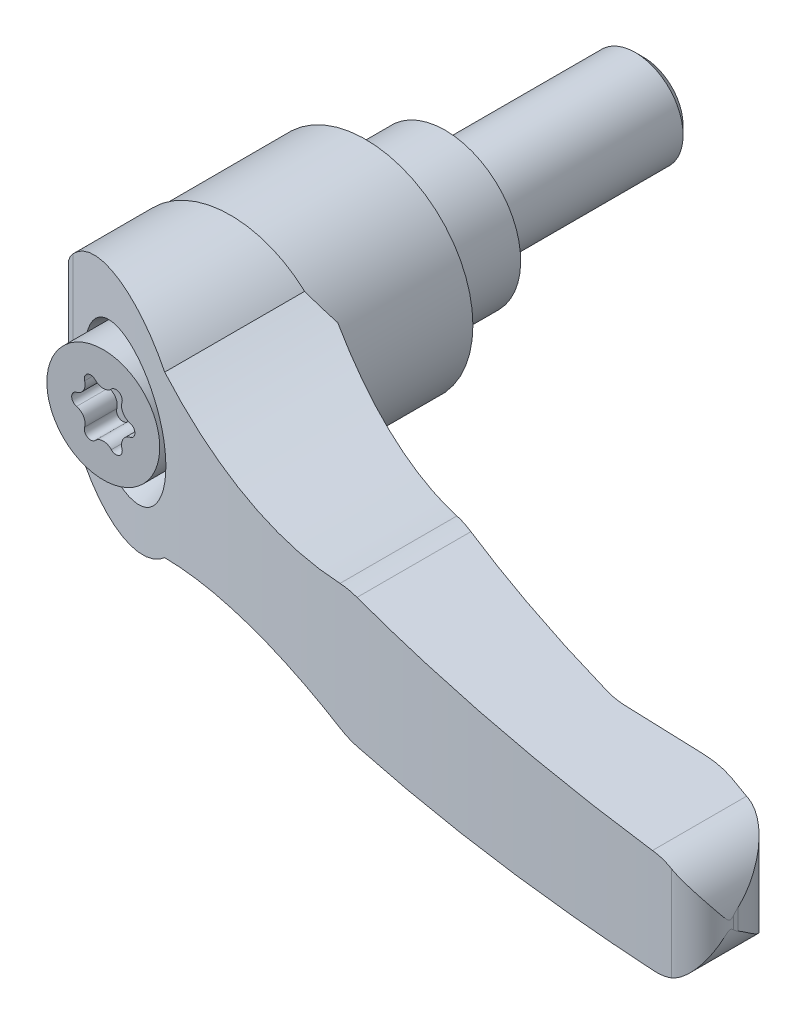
ISO-10303-21;
HEADER;
FILE_DESCRIPTION(('STEP AP214'),'2;1');
FILE_NAME('part.step','',(''),(''),'','','');
FILE_SCHEMA(('AUTOMOTIVE_DESIGN { 1 0 10303 214 1 1 1 1 }'));
ENDSEC;
DATA;
#1=APPLICATION_CONTEXT('core data for automotive mechanical design processes');
#2=APPLICATION_PROTOCOL_DEFINITION('international standard','automotive_design',2000,#1);
#3=PRODUCT_CONTEXT('',#1,'mechanical');
#4=PRODUCT('Part','Part','',(#3));
#5=PRODUCT_RELATED_PRODUCT_CATEGORY('part','',(#4));
#6=PRODUCT_DEFINITION_FORMATION('','',#4);
#7=PRODUCT_DEFINITION_CONTEXT('part definition',#1,'design');
#8=PRODUCT_DEFINITION('design','',#6,#7);
#9=PRODUCT_DEFINITION_SHAPE('','',#8);
#10=(LENGTH_UNIT() NAMED_UNIT(*) SI_UNIT(.MILLI.,.METRE.));
#11=(NAMED_UNIT(*) PLANE_ANGLE_UNIT() SI_UNIT($,.RADIAN.));
#12=(NAMED_UNIT(*) SI_UNIT($,.STERADIAN.) SOLID_ANGLE_UNIT());
#13=UNCERTAINTY_MEASURE_WITH_UNIT(LENGTH_MEASURE(1.E-05),#10,'distance_accuracy_value','');
#14=(GEOMETRIC_REPRESENTATION_CONTEXT(3) GLOBAL_UNCERTAINTY_ASSIGNED_CONTEXT((#13)) GLOBAL_UNIT_ASSIGNED_CONTEXT((#10,
#11,#12)) REPRESENTATION_CONTEXT('',''));
#15=CARTESIAN_POINT('',(0.,0.,0.));
#16=DIRECTION('',(0.,0.,1.));
#17=DIRECTION('',(1.,0.,0.));
#18=AXIS2_PLACEMENT_3D('',#15,#16,#17);
#19=CARTESIAN_POINT('',(2.462456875,0.,-25.));
#20=DIRECTION('',(0.,0.,-1.));
#21=DIRECTION('',(0.,1.,0.));
#22=AXIS2_PLACEMENT_3D('',#19,#20,#21);
#23=PLANE('',#22);
#24=CARTESIAN_POINT('',(0.,0.,-25.0000000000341));
#25=DIRECTION('',(0.,0.,1.));
#26=DIRECTION('',(0.,-1.,0.));
#27=AXIS2_PLACEMENT_3D('',#24,#25,#26);
#28=CIRCLE('',#27,4.92491375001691);
#29=CARTESIAN_POINT('',(0.,-4.92491375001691,-25.0000000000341));
#30=VERTEX_POINT('',#29);
#31=EDGE_CURVE('E19',#30,#30,#28,.T.);
#32=ORIENTED_EDGE('',*,*,#31,.F.);
#33=EDGE_LOOP('',(#32));
#34=FACE_BOUND('',#33,.T.);
#35=ADVANCED_FACE('F14',(#34),#23,.T.);
#36=CARTESIAN_POINT('',(0.,0.,-23.9249137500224));
#37=DIRECTION('',(0.,0.,1.));
#38=DIRECTION('',(0.,-1.,0.));
#39=AXIS2_PLACEMENT_3D('',#36,#37,#38);
#40=CONICAL_SURFACE('',#39,6.00000000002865,0.785398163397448);
#41=CARTESIAN_POINT('',(0.,0.,-23.92491375));
#42=DIRECTION('',(0.,0.,-1.));
#43=DIRECTION('',(0.,1.,0.));
#44=AXIS2_PLACEMENT_3D('',#41,#42,#43);
#45=CIRCLE('',#44,6.);
#46=CARTESIAN_POINT('',(0.,6.,-23.92491375));
#47=VERTEX_POINT('',#46);
#48=EDGE_CURVE('E230',#47,#47,#45,.F.);
#49=ORIENTED_EDGE('',*,*,#48,.F.);
#50=EDGE_LOOP('',(#49));
#51=FACE_BOUND('',#50,.T.);
#52=ORIENTED_EDGE('',*,*,#31,.T.);
#53=EDGE_LOOP('',(#52));
#54=FACE_BOUND('',#53,.T.);
#55=ADVANCED_FACE('F584',(#51,#54),#40,.T.);
#56=CARTESIAN_POINT('',(0.,0.,-11.962456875));
#57=DIRECTION('',(0.,0.,-1.));
#58=DIRECTION('',(0.,1.,0.));
#59=AXIS2_PLACEMENT_3D('',#56,#57,#58);
#60=CYLINDRICAL_SURFACE('',#59,6.);
#61=CARTESIAN_POINT('',(0.,0.,0.));
#62=DIRECTION('',(0.,0.,-1.));
#63=DIRECTION('',(0.,1.,0.));
#64=AXIS2_PLACEMENT_3D('',#61,#62,#63);
#65=CIRCLE('',#64,6.);
#66=CARTESIAN_POINT('',(0.,6.,0.));
#67=VERTEX_POINT('',#66);
#68=EDGE_CURVE('E245',#67,#67,#65,.F.);
#69=ORIENTED_EDGE('',*,*,#68,.F.);
#70=EDGE_LOOP('',(#69));
#71=FACE_BOUND('',#70,.T.);
#72=ORIENTED_EDGE('',*,*,#48,.T.);
#73=EDGE_LOOP('',(#72));
#74=FACE_BOUND('',#73,.T.);
#75=ADVANCED_FACE('F581',(#71,#74),#60,.T.);
#76=CARTESIAN_POINT('',(7.75,0.,0.));
#77=DIRECTION('',(0.,0.,-1.));
#78=DIRECTION('',(0.,1.,0.));
#79=AXIS2_PLACEMENT_3D('',#76,#77,#78);
#80=PLANE('',#79);
#81=ORIENTED_EDGE('',*,*,#68,.T.);
#82=EDGE_LOOP('',(#81));
#83=FACE_BOUND('',#82,.T.);
#84=CARTESIAN_POINT('',(0.,0.,0.));
#85=DIRECTION('',(0.,0.,-1.));
#86=DIRECTION('',(0.,1.,0.));
#87=AXIS2_PLACEMENT_3D('',#84,#85,#86);
#88=CIRCLE('',#87,9.5);
#89=CARTESIAN_POINT('',(0.,9.5,0.));
#90=VERTEX_POINT('',#89);
#91=EDGE_CURVE('E775',#90,#90,#88,.F.);
#92=ORIENTED_EDGE('',*,*,#91,.F.);
#93=EDGE_LOOP('',(#92));
#94=FACE_BOUND('',#93,.T.);
#95=ADVANCED_FACE('F578',(#83,#94),#80,.T.);
#96=CARTESIAN_POINT('',(0.,0.,12.4));
#97=DIRECTION('',(0.,0.,-1.));
#98=DIRECTION('',(0.,1.,0.));
#99=AXIS2_PLACEMENT_3D('',#96,#97,#98);
#100=CYLINDRICAL_SURFACE('',#99,9.5);
#101=ORIENTED_EDGE('',*,*,#91,.T.);
#102=EDGE_LOOP('',(#101));
#103=FACE_BOUND('',#102,.T.);
#104=CARTESIAN_POINT('',(0.,0.,10.7));
#105=DIRECTION('',(0.,0.,-1.));
#106=DIRECTION('',(1.,0.,0.));
#107=AXIS2_PLACEMENT_3D('',#104,#105,#106);
#108=CIRCLE('',#107,9.5);
#109=CARTESIAN_POINT('',(9.5,0.,10.7));
#110=VERTEX_POINT('',#109);
#111=EDGE_CURVE('E538',#110,#110,#108,.T.);
#112=ORIENTED_EDGE('',*,*,#111,.T.);
#113=EDGE_LOOP('',(#112));
#114=FACE_BOUND('',#113,.T.);
#115=ADVANCED_FACE('F640',(#103,#114),#100,.T.);
#116=CARTESIAN_POINT('',(0.,0.,10.4));
#117=DIRECTION('',(0.,0.,-1.));
#118=DIRECTION('',(0.,1.,0.));
#119=AXIS2_PLACEMENT_3D('',#116,#117,#118);
#120=CONICAL_SURFACE('',#119,9.8,0.785398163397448);
#121=ORIENTED_EDGE('',*,*,#111,.F.);
#122=EDGE_LOOP('',(#121));
#123=FACE_BOUND('',#122,.T.);
#124=CARTESIAN_POINT('',(0.,0.,10.4));
#125=DIRECTION('',(0.,0.,-1.));
#126=DIRECTION('',(0.,1.,0.));
#127=AXIS2_PLACEMENT_3D('',#124,#125,#126);
#128=CIRCLE('',#127,9.8);
#129=CARTESIAN_POINT('',(0.,9.8,10.4));
#130=VERTEX_POINT('',#129);
#131=EDGE_CURVE('E534',#130,#130,#128,.T.);
#132=ORIENTED_EDGE('',*,*,#131,.T.);
#133=EDGE_LOOP('',(#132));
#134=FACE_BOUND('',#133,.T.);
#135=ADVANCED_FACE('F647',(#123,#134),#120,.F.);
#136=CARTESIAN_POINT('',(0.,0.,9.7));
#137=DIRECTION('',(0.,0.,-1.));
#138=DIRECTION('',(0.,1.,0.));
#139=AXIS2_PLACEMENT_3D('',#136,#137,#138);
#140=CYLINDRICAL_SURFACE('',#139,9.8);
#141=ORIENTED_EDGE('',*,*,#131,.F.);
#142=EDGE_LOOP('',(#141));
#143=FACE_BOUND('',#142,.T.);
#144=CARTESIAN_POINT('',(0.,0.,10.));
#145=DIRECTION('',(0.,0.,-1.));
#146=DIRECTION('',(0.,1.,0.));
#147=AXIS2_PLACEMENT_3D('',#144,#145,#146);
#148=CIRCLE('',#147,9.8);
#149=CARTESIAN_POINT('',(0.,9.8,10.));
#150=VERTEX_POINT('',#149);
#151=EDGE_CURVE('E537',#150,#150,#148,.F.);
#152=ORIENTED_EDGE('',*,*,#151,.F.);
#153=EDGE_LOOP('',(#152));
#154=FACE_BOUND('',#153,.T.);
#155=ADVANCED_FACE('F654',(#143,#154),#140,.F.);
#156=CARTESIAN_POINT('',(-13.2600377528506,-27.5,10.));
#157=DIRECTION('',(0.707106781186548,0.,0.707106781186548));
#158=DIRECTION('',(-0.707106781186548,0.,0.707106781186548));
#159=AXIS2_PLACEMENT_3D('',#156,#157,#158);
#160=PLANE('',#159);
#161=DIRECTION('',(0.,1.,0.));
#162=VECTOR('',#161,1.);
#163=CARTESIAN_POINT('',(-13.2600377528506,0.,10.));
#164=LINE('',#163,#162);
#165=CARTESIAN_POINT('',(-13.2600377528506,-2.58582666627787,10.));
#166=VERTEX_POINT('',#165);
#167=CARTESIAN_POINT('',(-13.2600377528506,2.58582666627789,10.));
#168=VERTEX_POINT('',#167);
#169=EDGE_CURVE('E770',#166,#168,#164,.T.);
#170=ORIENTED_EDGE('',*,*,#169,.F.);
#171=CARTESIAN_POINT('',(-0.00999999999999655,0.,-3.25003775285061));
#172=DIRECTION('',(0.707106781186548,0.,0.707106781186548));
#173=DIRECTION('',(-0.707106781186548,0.,0.707106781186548));
#174=AXIS2_PLACEMENT_3D('',#171,#172,#173);
#175=ELLIPSE('',#174,19.0918830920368,13.5);
#176=EDGE_CURVE('E767',#168,#166,#175,.T.);
#177=ORIENTED_EDGE('',*,*,#176,.F.);
#178=EDGE_LOOP('',(#170,#177));
#179=FACE_BOUND('',#178,.T.);
#180=ADVANCED_FACE('F658',(#179),#160,.F.);
#181=CARTESIAN_POINT('',(-6.76,0.,10.));
#182=DIRECTION('',(0.,0.,-1.));
#183=DIRECTION('',(0.,1.,0.));
#184=AXIS2_PLACEMENT_3D('',#181,#182,#183);
#185=PLANE('',#184);
#186=ORIENTED_EDGE('',*,*,#169,.T.);
#187=CARTESIAN_POINT('',(-0.00999999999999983,0.,10.));
#188=DIRECTION('',(0.,0.,1.));
#189=DIRECTION('',(-1.,0.,0.));
#190=AXIS2_PLACEMENT_3D('',#187,#188,#189);
#191=CIRCLE('',#190,13.5);
#192=EDGE_CURVE('E764',#166,#168,#191,.T.);
#193=ORIENTED_EDGE('',*,*,#192,.F.);
#194=EDGE_LOOP('',(#186,#193));
#195=FACE_BOUND('',#194,.T.);
#196=ORIENTED_EDGE('',*,*,#151,.T.);
#197=EDGE_LOOP('',(#196));
#198=FACE_BOUND('',#197,.T.);
#199=ADVANCED_FACE('F662',(#195,#198),#185,.T.);
#200=CARTESIAN_POINT('',(-0.0100000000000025,0.,20.75));
#201=DIRECTION('',(0.,0.,1.));
#202=DIRECTION('',(-1.,0.,0.));
#203=AXIS2_PLACEMENT_3D('',#200,#201,#202);
#204=CYLINDRICAL_SURFACE('',#203,13.5);
#205=ORIENTED_EDGE('',*,*,#192,.T.);
#206=ORIENTED_EDGE('',*,*,#176,.T.);
#207=EDGE_LOOP('',(#205,#206));
#208=FACE_BOUND('',#207,.T.);
#209=CARTESIAN_POINT('',(-0.010000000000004,0.,27.));
#210=DIRECTION('',(0.,0.,1.));
#211=DIRECTION('',(-1.,0.,0.));
#212=AXIS2_PLACEMENT_3D('',#209,#210,#211);
#213=CIRCLE('',#212,13.5);
#214=CARTESIAN_POINT('',(-13.51,0.,27.));
#215=VERTEX_POINT('',#214);
#216=CARTESIAN_POINT('',(13.4899999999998,0.,27.));
#217=VERTEX_POINT('',#216);
#218=EDGE_CURVE('E745',#215,#217,#213,.T.);
#219=ORIENTED_EDGE('',*,*,#218,.F.);
#220=CARTESIAN_POINT('',(-0.010000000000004,0.,27.));
#221=DIRECTION('',(0.,0.,1.));
#222=DIRECTION('',(-1.,0.,0.));
#223=AXIS2_PLACEMENT_3D('',#220,#221,#222);
#224=CIRCLE('',#223,13.5);
#225=EDGE_CURVE('E756',#217,#215,#224,.T.);
#226=ORIENTED_EDGE('',*,*,#225,.F.);
#227=EDGE_LOOP('',(#219,#226));
#228=FACE_BOUND('',#227,.T.);
#229=ADVANCED_FACE('F666',(#208,#228),#204,.T.);
#230=CARTESIAN_POINT('',(94.8688366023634,-14.75,58.0130023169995));
#231=DIRECTION('',(0.992331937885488,0.,-0.123601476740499));
#232=DIRECTION('',(0.123601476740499,0.,0.992331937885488));
#233=AXIS2_PLACEMENT_3D('',#230,#231,#232);
#234=PLANE('',#233);
#235=CARTESIAN_POINT('',(88.5,0.,6.88092740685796));
#236=DIRECTION('',(0.992331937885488,0.,-0.123601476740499));
#237=DIRECTION('',(0.123601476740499,0.,0.992331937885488));
#238=AXIS2_PLACEMENT_3D('',#235,#236,#237);
#239=ELLIPSE('',#238,52.588368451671,6.5);
#240=CARTESIAN_POINT('',(94.9511621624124,-0.795302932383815,58.6739513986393));
#241=VERTEX_POINT('',#240);
#242=CARTESIAN_POINT('',(94.8688366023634,-1.29919988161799,58.0130023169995));
#243=VERTEX_POINT('',#242);
#244=EDGE_CURVE('E758',#241,#243,#239,.T.);
#245=ORIENTED_EDGE('',*,*,#244,.T.);
#246=DIRECTION('',(0.,-1.,0.));
#247=VECTOR('',#246,1.);
#248=CARTESIAN_POINT('',(94.8688366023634,-14.75,58.0130023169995));
#249=LINE('',#248,#247);
#250=CARTESIAN_POINT('',(94.8688366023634,1.29919988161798,58.0130023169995));
#251=VERTEX_POINT('',#250);
#252=EDGE_CURVE('E528',#251,#243,#249,.T.);
#253=ORIENTED_EDGE('',*,*,#252,.F.);
#254=CARTESIAN_POINT('',(88.5,0.,6.88092740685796));
#255=DIRECTION('',(0.992331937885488,0.,-0.123601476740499));
#256=DIRECTION('',(0.123601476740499,0.,0.992331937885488));
#257=AXIS2_PLACEMENT_3D('',#254,#255,#256);
#258=ELLIPSE('',#257,52.588368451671,6.5);
#259=CARTESIAN_POINT('',(94.9511621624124,0.795302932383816,58.6739513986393));
#260=VERTEX_POINT('',#259);
#261=EDGE_CURVE('E761',#251,#260,#258,.T.);
#262=ORIENTED_EDGE('',*,*,#261,.T.);
#263=DIRECTION('',(0.,-1.,0.));
#264=VECTOR('',#263,1.);
#265=CARTESIAN_POINT('',(94.9511621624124,-14.75,58.6739513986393));
#266=LINE('',#265,#264);
#267=EDGE_CURVE('E760',#260,#241,#266,.T.);
#268=ORIENTED_EDGE('',*,*,#267,.T.);
#269=EDGE_LOOP('',(#245,#253,#262,#268));
#270=FACE_BOUND('',#269,.T.);
#271=ADVANCED_FACE('F670',(#270),#234,.T.);
#272=CARTESIAN_POINT('',(-13.51,-14.75,27.));
#273=DIRECTION('',(0.,0.,-1.));
#274=DIRECTION('',(0.,1.,0.));
#275=AXIS2_PLACEMENT_3D('',#272,#273,#274);
#276=PLANE('',#275);
#277=DIRECTION('',(0.,-1.,0.));
#278=VECTOR('',#277,1.);
#279=CARTESIAN_POINT('',(-13.51,-14.75,27.));
#280=LINE('',#279,#278);
#281=CARTESIAN_POINT('',(-13.51,2.55781156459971,27.));
#282=VERTEX_POINT('',#281);
#283=EDGE_CURVE('E532',#282,#215,#280,.T.);
#284=ORIENTED_EDGE('',*,*,#283,.F.);
#285=CARTESIAN_POINT('',(0.,0.,27.));
#286=DIRECTION('',(0.,0.,1.));
#287=DIRECTION('',(0.,-1.,0.));
#288=AXIS2_PLACEMENT_3D('',#285,#286,#287);
#289=CIRCLE('',#288,13.75);
#290=CARTESIAN_POINT('',(9.32365402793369,10.1060365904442,27.));
#291=VERTEX_POINT('',#290);
#292=EDGE_CURVE('E437',#291,#282,#289,.T.);
#293=ORIENTED_EDGE('',*,*,#292,.F.);
#294=CARTESIAN_POINT('',(29.15,64.91,27.));
#295=DIRECTION('',(0.,0.,1.));
#296=DIRECTION('',(0.,-1.,0.));
#297=AXIS2_PLACEMENT_3D('',#294,#295,#296);
#298=CIRCLE('',#297,58.28);
#299=CARTESIAN_POINT('',(13.4899999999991,8.77335599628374,27.));
#300=VERTEX_POINT('',#299);
#301=EDGE_CURVE('E399',#291,#300,#298,.T.);
#302=ORIENTED_EDGE('',*,*,#301,.T.);
#303=DIRECTION('',(0.,-1.,0.));
#304=VECTOR('',#303,1.);
#305=CARTESIAN_POINT('',(13.4899999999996,-14.75,27.0000000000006));
#306=LINE('',#305,#304);
#307=EDGE_CURVE('E715',#300,#217,#306,.T.);
#308=ORIENTED_EDGE('',*,*,#307,.T.);
#309=ORIENTED_EDGE('',*,*,#225,.T.);
#310=EDGE_LOOP('',(#284,#293,#302,#308,#309));
#311=FACE_BOUND('',#310,.T.);
#312=ADVANCED_FACE('F674',(#311),#276,.T.);
#313=CARTESIAN_POINT('',(-13.51,-14.75,31.4135672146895));
#314=DIRECTION('',(-1.,0.,0.));
#315=DIRECTION('',(0.,-1.,0.));
#316=AXIS2_PLACEMENT_3D('',#313,#314,#315);
#317=PLANE('',#316);
#318=DIRECTION('',(0.,0.,1.));
#319=VECTOR('',#318,1.);
#320=CARTESIAN_POINT('',(-13.51,-2.5578115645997,63.));
#321=LINE('',#320,#319);
#322=CARTESIAN_POINT('',(-13.51,-2.55781156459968,31.4135672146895));
#323=VERTEX_POINT('',#322);
#324=CARTESIAN_POINT('',(-13.51,-2.55781156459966,27.));
#325=VERTEX_POINT('',#324);
#326=EDGE_CURVE('E752',#323,#325,#321,.F.);
#327=ORIENTED_EDGE('',*,*,#326,.F.);
#328=DIRECTION('',(0.,-1.,0.));
#329=VECTOR('',#328,1.);
#330=CARTESIAN_POINT('',(-13.51,-14.75,31.4135672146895));
#331=LINE('',#330,#329);
#332=CARTESIAN_POINT('',(-13.51,2.55781156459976,31.4135672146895));
#333=VERTEX_POINT('',#332);
#334=EDGE_CURVE('E451',#333,#323,#331,.T.);
#335=ORIENTED_EDGE('',*,*,#334,.F.);
#336=DIRECTION('',(0.,0.,1.));
#337=VECTOR('',#336,1.);
#338=CARTESIAN_POINT('',(-13.51,2.55781156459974,63.));
#339=LINE('',#338,#337);
#340=EDGE_CURVE('E440',#282,#333,#339,.T.);
#341=ORIENTED_EDGE('',*,*,#340,.F.);
#342=ORIENTED_EDGE('',*,*,#283,.T.);
#343=DIRECTION('',(0.,1.,0.));
#344=VECTOR('',#343,1.);
#345=CARTESIAN_POINT('',(-13.51,-14.75,27.));
#346=LINE('',#345,#344);
#347=EDGE_CURVE('E747',#325,#215,#346,.T.);
#348=ORIENTED_EDGE('',*,*,#347,.F.);
#349=EDGE_LOOP('',(#327,#335,#341,#342,#348));
#350=FACE_BOUND('',#349,.T.);
#351=ADVANCED_FACE('F678',(#350),#317,.T.);
#352=CARTESIAN_POINT('',(-13.51,-14.75,27.));
#353=DIRECTION('',(0.,0.,-1.));
#354=DIRECTION('',(0.,1.,0.));
#355=AXIS2_PLACEMENT_3D('',#352,#353,#354);
#356=PLANE('',#355);
#357=ORIENTED_EDGE('',*,*,#218,.T.);
#358=DIRECTION('',(0.,-1.,0.));
#359=VECTOR('',#358,1.);
#360=CARTESIAN_POINT('',(13.4899999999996,-14.75,27.0000000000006));
#361=LINE('',#360,#359);
#362=CARTESIAN_POINT('',(13.4899999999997,-8.77335599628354,27.));
#363=VERTEX_POINT('',#362);
#364=EDGE_CURVE('E827',#217,#363,#361,.T.);
#365=ORIENTED_EDGE('',*,*,#364,.T.);
#366=CARTESIAN_POINT('',(29.15,-64.91,27.));
#367=DIRECTION('',(0.,0.,1.));
#368=DIRECTION('',(0.,-1.,0.));
#369=AXIS2_PLACEMENT_3D('',#366,#367,#368);
#370=CIRCLE('',#369,58.28);
#371=CARTESIAN_POINT('',(9.32365402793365,-10.1060365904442,27.));
#372=VERTEX_POINT('',#371);
#373=EDGE_CURVE('E870',#363,#372,#370,.T.);
#374=ORIENTED_EDGE('',*,*,#373,.T.);
#375=CARTESIAN_POINT('',(0.,0.,27.));
#376=DIRECTION('',(0.,0.,1.));
#377=DIRECTION('',(0.,-1.,0.));
#378=AXIS2_PLACEMENT_3D('',#375,#376,#377);
#379=CIRCLE('',#378,13.75);
#380=EDGE_CURVE('E868',#325,#372,#379,.T.);
#381=ORIENTED_EDGE('',*,*,#380,.F.);
#382=ORIENTED_EDGE('',*,*,#347,.T.);
#383=EDGE_LOOP('',(#357,#365,#374,#381,#382));
#384=FACE_BOUND('',#383,.T.);
#385=ADVANCED_FACE('F682',(#384),#356,.T.);
#386=CARTESIAN_POINT('',(81.4673032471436,-14.75,62.36));
#387=DIRECTION('',(0.,-1.,0.));
#388=DIRECTION('',(1.,0.,0.));
#389=AXIS2_PLACEMENT_3D('',#386,#387,#388);
#390=CYLINDRICAL_SURFACE('',#389,13.39);
#391=CARTESIAN_POINT('',(81.4673032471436,-6.75541913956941,62.36));
#392=DIRECTION('',(-0.0362948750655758,0.999341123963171,0.));
#393=DIRECTION('',(-0.999341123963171,-0.0362948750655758,0.));
#394=AXIS2_PLACEMENT_3D('',#391,#392,#393);
#395=ELLIPSE('',#394,13.3988281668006,13.39);
#396=CARTESIAN_POINT('',(85.7182287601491,-6.60103060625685,49.6626879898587));
#397=VERTEX_POINT('',#396);
#398=CARTESIAN_POINT('',(81.4673032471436,-6.75541913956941,48.97));
#399=VERTEX_POINT('',#398);
#400=EDGE_CURVE('E709',#397,#399,#395,.T.);
#401=ORIENTED_EDGE('',*,*,#400,.T.);
#402=DIRECTION('',(0.,1.,0.));
#403=VECTOR('',#402,1.);
#404=CARTESIAN_POINT('',(81.4673032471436,-14.75,48.97));
#405=LINE('',#404,#403);
#406=CARTESIAN_POINT('',(81.4673032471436,6.75541913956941,48.97));
#407=VERTEX_POINT('',#406);
#408=EDGE_CURVE('E704',#407,#399,#405,.F.);
#409=ORIENTED_EDGE('',*,*,#408,.F.);
#410=CARTESIAN_POINT('',(81.4673032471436,6.75541913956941,62.36));
#411=DIRECTION('',(-0.0362948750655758,-0.999341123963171,0.));
#412=DIRECTION('',(0.999341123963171,-0.0362948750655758,0.));
#413=AXIS2_PLACEMENT_3D('',#410,#411,#412);
#414=ELLIPSE('',#413,13.3988281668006,13.39);
#415=CARTESIAN_POINT('',(85.7182287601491,6.60103060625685,49.6626879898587));
#416=VERTEX_POINT('',#415);
#417=EDGE_CURVE('E401',#407,#416,#414,.T.);
#418=ORIENTED_EDGE('',*,*,#417,.T.);
#419=DIRECTION('',(0.,-1.,0.));
#420=VECTOR('',#419,1.);
#421=CARTESIAN_POINT('',(85.7182287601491,-14.75,49.6626879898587));
#422=LINE('',#421,#420);
#423=EDGE_CURVE('E742',#397,#416,#422,.F.);
#424=ORIENTED_EDGE('',*,*,#423,.F.);
#425=EDGE_LOOP('',(#401,#409,#418,#424));
#426=FACE_BOUND('',#425,.T.);
#427=ADVANCED_FACE('F686',(#426),#390,.T.);
#428=CARTESIAN_POINT('',(71.6523269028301,-14.75,48.97));
#429=DIRECTION('',(0.,0.,-1.));
#430=DIRECTION('',(0.,1.,0.));
#431=AXIS2_PLACEMENT_3D('',#428,#429,#430);
#432=PLANE('',#431);
#433=DIRECTION('',(-0.999341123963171,-0.0362948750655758,0.));
#434=VECTOR('',#433,1.);
#435=CARTESIAN_POINT('',(88.5,-6.5,48.97));
#436=LINE('',#435,#434);
#437=CARTESIAN_POINT('',(71.6523269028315,-7.11188734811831,48.97));
#438=VERTEX_POINT('',#437);
#439=EDGE_CURVE('E699',#399,#438,#436,.T.);
#440=ORIENTED_EDGE('',*,*,#439,.T.);
#441=DIRECTION('',(0.,-1.,0.));
#442=VECTOR('',#441,1.);
#443=CARTESIAN_POINT('',(71.6523269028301,-14.75,48.97));
#444=LINE('',#443,#442);
#445=CARTESIAN_POINT('',(71.6523269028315,7.11188734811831,48.97));
#446=VERTEX_POINT('',#445);
#447=EDGE_CURVE('E702',#438,#446,#444,.F.);
#448=ORIENTED_EDGE('',*,*,#447,.T.);
#449=DIRECTION('',(0.999341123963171,-0.0362948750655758,0.));
#450=VECTOR('',#449,1.);
#451=CARTESIAN_POINT('',(43.9670619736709,8.1173830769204,48.97));
#452=LINE('',#451,#450);
#453=EDGE_CURVE('E835',#446,#407,#452,.T.);
#454=ORIENTED_EDGE('',*,*,#453,.T.);
#455=ORIENTED_EDGE('',*,*,#408,.T.);
#456=EDGE_LOOP('',(#440,#448,#454,#455));
#457=FACE_BOUND('',#456,.T.);
#458=ADVANCED_FACE('F689',(#457),#432,.T.);
#459=CARTESIAN_POINT('',(71.6523269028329,-14.75,38.8899999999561));
#460=DIRECTION('',(0.,-1.,0.));
#461=DIRECTION('',(1.,0.,0.));
#462=AXIS2_PLACEMENT_3D('',#459,#460,#461);
#463=CYLINDRICAL_SURFACE('',#462,10.0800000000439);
#464=ORIENTED_EDGE('',*,*,#447,.F.);
#465=CARTESIAN_POINT('',(71.6523269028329,-7.11188734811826,38.8899999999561));
#466=DIRECTION('',(-0.0362948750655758,0.999341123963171,0.));
#467=DIRECTION('',(-0.999341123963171,-0.0362948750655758,0.));
#468=AXIS2_PLACEMENT_3D('',#465,#466,#467);
#469=ELLIPSE('',#468,10.086645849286,10.0800000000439);
#470=CARTESIAN_POINT('',(69.1344137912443,-7.20333494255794,48.6504566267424));
#471=VERTEX_POINT('',#470);
#472=EDGE_CURVE('E708',#438,#471,#469,.F.);
#473=ORIENTED_EDGE('',*,*,#472,.T.);
#474=DIRECTION('',(0.,-1.,0.));
#475=VECTOR('',#474,1.);
#476=CARTESIAN_POINT('',(69.1344156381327,-14.75,48.6504571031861));
#477=LINE('',#476,#475);
#478=CARTESIAN_POINT('',(69.1344137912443,7.20333494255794,48.6504566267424));
#479=VERTEX_POINT('',#478);
#480=EDGE_CURVE('E825',#471,#479,#477,.F.);
#481=ORIENTED_EDGE('',*,*,#480,.T.);
#482=CARTESIAN_POINT('',(71.6523269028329,7.11188734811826,38.8899999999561));
#483=DIRECTION('',(-0.0362948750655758,-0.999341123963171,0.));
#484=DIRECTION('',(0.999341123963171,-0.0362948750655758,0.));
#485=AXIS2_PLACEMENT_3D('',#482,#483,#484);
#486=ELLIPSE('',#485,10.086645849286,10.0800000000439);
#487=EDGE_CURVE('E713',#479,#446,#486,.F.);
#488=ORIENTED_EDGE('',*,*,#487,.T.);
#489=EDGE_LOOP('',(#464,#473,#481,#488));
#490=FACE_BOUND('',#489,.T.);
#491=ADVANCED_FACE('F409',(#490),#463,.F.);
#492=CARTESIAN_POINT('',(132.162219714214,-14.75,-195.670803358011));
#493=DIRECTION('',(0.,-1.,0.));
#494=DIRECTION('',(1.,0.,0.));
#495=AXIS2_PLACEMENT_3D('',#492,#493,#494);
#496=CYLINDRICAL_SURFACE('',#495,252.32);
#497=CARTESIAN_POINT('',(43.9670619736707,8.11738307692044,40.7335040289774));
#498=CARTESIAN_POINT('',(43.7285909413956,8.12604852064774,40.6445396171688));
#499=CARTESIAN_POINT('',(43.4900264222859,8.12742192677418,40.5551257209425));
#500=CARTESIAN_POINT('',(43.014251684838,8.11567103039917,40.375985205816));
#501=CARTESIAN_POINT('',(42.7770395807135,8.10259351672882,40.2862605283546));
#502=CARTESIAN_POINT('',(42.3039618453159,8.06208212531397,40.1065066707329));
#503=CARTESIAN_POINT('',(42.0680962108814,8.03464828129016,40.0164774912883));
#504=CARTESIAN_POINT('',(41.5977019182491,7.96541677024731,39.8361272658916));
#505=CARTESIAN_POINT('',(41.3631800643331,7.92357286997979,39.7458062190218));
#506=CARTESIAN_POINT('',(41.1300932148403,7.87460952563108,39.6556387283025));
#507=B_SPLINE_CURVE_WITH_KNOTS('',3,(#497,#498,#499,#500,#501,#502,#503,#504,#505,#506),
.UNSPECIFIED.,.F.,.F.,(4,2,2,2,4),(0.,0.763908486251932,1.52535083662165,2.28679139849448,
3.05069808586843),.UNSPECIFIED.);
#508=CARTESIAN_POINT('',(43.9670619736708,8.11738307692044,40.7335040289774));
#509=VERTEX_POINT('',#508);
#510=CARTESIAN_POINT('',(41.1300932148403,7.87460952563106,39.6556387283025));
#511=VERTEX_POINT('',#510);
#512=EDGE_CURVE('E389',#509,#511,#507,.T.);
#513=ORIENTED_EDGE('',*,*,#512,.F.);
#514=CARTESIAN_POINT('',(132.162219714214,4.9142403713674,-195.670803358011));
#515=DIRECTION('',(-0.0362948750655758,-0.999341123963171,0.));
#516=DIRECTION('',(0.999341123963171,-0.0362948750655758,0.));
#517=AXIS2_PLACEMENT_3D('',#514,#515,#516);
#518=ELLIPSE('',#517,252.486357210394,252.32);
#519=EDGE_CURVE('E840',#509,#479,#518,.F.);
#520=ORIENTED_EDGE('',*,*,#519,.T.);
#521=ORIENTED_EDGE('',*,*,#480,.F.);
#522=CARTESIAN_POINT('',(132.162219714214,-4.91424037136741,-195.670803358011));
#523=DIRECTION('',(-0.0362948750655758,0.999341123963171,0.));
#524=DIRECTION('',(-0.999341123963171,-0.0362948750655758,0.));
#525=AXIS2_PLACEMENT_3D('',#522,#523,#524);
#526=ELLIPSE('',#525,252.486357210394,252.32);
#527=CARTESIAN_POINT('',(43.9670619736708,-8.11738307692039,40.7335040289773));
#528=VERTEX_POINT('',#527);
#529=EDGE_CURVE('E719',#471,#528,#526,.F.);
#530=ORIENTED_EDGE('',*,*,#529,.T.);
#531=CARTESIAN_POINT('',(41.1300929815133,-7.87460947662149,39.6556386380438));
#532=CARTESIAN_POINT('',(41.3631798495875,-7.92357282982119,39.7458061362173));
#533=CARTESIAN_POINT('',(41.5977017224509,-7.96541673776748,39.8361271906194));
#534=CARTESIAN_POINT('',(42.0680960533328,-8.03464826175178,40.0164774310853));
#535=CARTESIAN_POINT('',(42.3039617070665,-8.06208211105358,40.1065066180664));
#536=CARTESIAN_POINT('',(42.7770394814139,-8.10259351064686,40.2862604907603));
#537=CARTESIAN_POINT('',(43.0142516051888,-8.11567102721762,40.3759851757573));
#538=CARTESIAN_POINT('',(43.4900263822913,-8.12742192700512,40.5551257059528));
#539=CARTESIAN_POINT('',(43.7285909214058,-8.12604852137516,40.6445396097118));
#540=CARTESIAN_POINT('',(43.9670619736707,-8.11738307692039,40.7335040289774));
#541=B_SPLINE_CURVE_WITH_KNOTS('',3,(#531,#532,#533,#534,#535,#536,#537,#538,#539,#540),
.UNSPECIFIED.,.F.,.F.,(4,2,2,2,4),(0.,0.763906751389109,1.52534737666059,2.28678979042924,
3.05069834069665),.UNSPECIFIED.);
#542=CARTESIAN_POINT('',(41.1300929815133,-7.8746094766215,39.6556386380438));
#543=VERTEX_POINT('',#542);
#544=EDGE_CURVE('E424',#543,#528,#541,.T.);
#545=ORIENTED_EDGE('',*,*,#544,.F.);
#546=CARTESIAN_POINT('',(41.1300929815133,-7.87460947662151,39.6556386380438));
#547=CARTESIAN_POINT('',(40.2468666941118,-7.68907790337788,39.3139933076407));
#548=CARTESIAN_POINT('',(39.3617638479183,-7.52459842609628,38.9658739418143));
#549=CARTESIAN_POINT('',(37.5897998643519,-7.23736069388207,38.2572801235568));
#550=CARTESIAN_POINT('',(36.7029388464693,-7.11459969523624,37.8968064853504));
#551=CARTESIAN_POINT('',(34.9294341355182,-6.91040287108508,37.1640922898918));
#552=CARTESIAN_POINT('',(34.0427904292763,-6.8289625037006,36.7918530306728));
#553=CARTESIAN_POINT('',(32.2715033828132,-6.70688253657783,36.0362417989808));
#554=CARTESIAN_POINT('',(31.3868600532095,-6.66624315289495,35.652869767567));
#555=CARTESIAN_POINT('',(28.7704435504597,-6.60545291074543,34.5011035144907));
#556=CARTESIAN_POINT('',(27.0436661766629,-6.64276527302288,33.7176215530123));
#557=CARTESIAN_POINT('',(23.6170342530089,-6.86784257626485,32.1161606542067));
#558=CARTESIAN_POINT('',(21.9171693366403,-7.05554807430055,31.2981954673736));
#559=CARTESIAN_POINT('',(19.6661800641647,-7.4039275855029,30.1840812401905));
#560=CARTESIAN_POINT('',(19.0983988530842,-7.50046620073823,29.9003744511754));
#561=CARTESIAN_POINT('',(17.9675115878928,-7.70999213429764,29.3299782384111));
#562=CARTESIAN_POINT('',(17.4044045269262,-7.82297580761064,29.043289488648));
#563=CARTESIAN_POINT('',(16.2796310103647,-8.06595772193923,28.4653390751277));
#564=CARTESIAN_POINT('',(15.7179955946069,-8.19605796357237,28.1740600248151));
#565=CARTESIAN_POINT('',(14.5999573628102,-8.472545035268,27.5889003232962));
#566=CARTESIAN_POINT('',(14.0435556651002,-8.61893526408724,27.2950191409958));
#567=CARTESIAN_POINT('',(13.4899999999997,-8.77335599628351,27.0000000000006));
#568=B_SPLINE_CURVE_WITH_KNOTS('',3,(#546,#547,#548,#549,#550,#551,#552,#553,#554,#555,#556,
#557,#558,#559,#560,#561,#562,#563,#564,#565,#566,#567),.UNSPECIFIED.,.F.,.F.,(4,2,2,2,2,2,2,2,
2,2,4),(0.,2.89469970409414,5.78920899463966,8.6834000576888,11.5776064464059,17.2602540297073,
22.940656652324,24.866551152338,26.7920194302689,28.7295308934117,30.6674473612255),.UNSPECIFIED.);
#569=EDGE_CURVE('E415',#543,#363,#568,.T.);
#570=ORIENTED_EDGE('',*,*,#569,.T.);
#571=ORIENTED_EDGE('',*,*,#364,.F.);
#572=ORIENTED_EDGE('',*,*,#307,.F.);
#573=CARTESIAN_POINT('',(13.4899999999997,8.77335599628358,27.0000000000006));
#574=CARTESIAN_POINT('',(14.31664655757,8.54275177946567,27.4405727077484));
#575=CARTESIAN_POINT('',(15.149663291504,8.33005321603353,27.8786057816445));
#576=CARTESIAN_POINT('',(16.82730612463,7.94113938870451,28.7487404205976));
#577=CARTESIAN_POINT('',(17.6719330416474,7.76492670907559,29.1808415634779));
#578=CARTESIAN_POINT('',(19.3724293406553,7.44952599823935,30.0386421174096));
#579=CARTESIAN_POINT('',(20.2283094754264,7.31037656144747,30.4643344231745));
#580=CARTESIAN_POINT('',(21.9491324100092,7.07004305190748,31.3079971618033));
#581=CARTESIAN_POINT('',(22.8140749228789,6.96885778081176,31.725967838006));
#582=CARTESIAN_POINT('',(24.5350860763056,6.80669813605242,32.5454832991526));
#583=CARTESIAN_POINT('',(25.3910090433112,6.74499321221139,32.9471893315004));
#584=CARTESIAN_POINT('',(27.1088771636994,6.65940525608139,33.7416486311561));
#585=CARTESIAN_POINT('',(27.9708222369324,6.63552172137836,34.1344020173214));
#586=CARTESIAN_POINT('',(29.6986634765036,6.62618362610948,34.9099811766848));
#587=CARTESIAN_POINT('',(30.5645565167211,6.64070263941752,35.2928135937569));
#588=CARTESIAN_POINT('',(32.2992228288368,6.70867652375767,36.0481188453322));
#589=CARTESIAN_POINT('',(33.1679956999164,6.76212618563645,36.4205930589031));
#590=CARTESIAN_POINT('',(34.6268488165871,6.88489763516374,37.0364018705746));
#591=CARTESIAN_POINT('',(35.2165959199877,6.94356774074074,37.2827020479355));
#592=CARTESIAN_POINT('',(36.396064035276,7.07916681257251,37.7700518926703));
#593=CARTESIAN_POINT('',(36.9857850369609,7.15609293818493,38.0111023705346));
#594=CARTESIAN_POINT('',(38.1685846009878,7.32890006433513,38.4893735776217));
#595=CARTESIAN_POINT('',(38.7616598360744,7.42490199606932,38.7265588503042));
#596=CARTESIAN_POINT('',(39.9468049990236,7.63566195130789,39.1953420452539));
#597=CARTESIAN_POINT('',(40.5388747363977,7.75042319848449,39.4269389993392));
#598=CARTESIAN_POINT('',(41.1300932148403,7.87460952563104,39.6556387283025));
#599=B_SPLINE_CURVE_WITH_KNOTS('',3,(#573,#574,#575,#576,#577,#578,#579,#580,#581,#582,#583,
#584,#585,#586,#587,#588,#589,#590,#591,#592,#593,#594,#595,#596,#597,#598),.UNSPECIFIED.,.F.,
.F.,(4,2,2,2,2,2,2,2,2,2,2,2,4),(0.,2.89390785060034,5.78802060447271,8.68513535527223,
11.5821586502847,14.4238937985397,17.2655911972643,20.1053336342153,22.9446961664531,
24.8698413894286,26.7946872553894,28.7321491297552,30.6699442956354),.UNSPECIFIED.);
#600=EDGE_CURVE('E430',#300,#511,#599,.T.);
#601=ORIENTED_EDGE('',*,*,#600,.T.);
#602=EDGE_LOOP('',(#513,#520,#521,#530,#545,#570,#571,#572,#601));
#603=FACE_BOUND('',#602,.T.);
#604=ADVANCED_FACE('F403',(#603),#496,.F.);
#605=CARTESIAN_POINT('',(85.7182287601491,-14.75,49.6626879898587));
#606=DIRECTION('',(0.317470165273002,0.,-0.948268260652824));
#607=DIRECTION('',(0.948268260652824,0.,0.317470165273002));
#608=AXIS2_PLACEMENT_3D('',#605,#606,#607);
#609=PLANE('',#608);
#610=DIRECTION('',(-0.947706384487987,-0.0344195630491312,-0.317282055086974));
#611=VECTOR('',#610,1.);
#612=CARTESIAN_POINT('',(88.5,-6.5,50.5939955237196));
#613=LINE('',#612,#611);
#614=CARTESIAN_POINT('',(88.5,-6.5,50.5939955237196));
#615=VERTEX_POINT('',#614);
#616=EDGE_CURVE('E733',#615,#397,#613,.T.);
#617=ORIENTED_EDGE('',*,*,#616,.T.);
#618=ORIENTED_EDGE('',*,*,#423,.T.);
#619=DIRECTION('',(0.947706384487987,-0.0344195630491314,0.317282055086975));
#620=VECTOR('',#619,1.);
#621=CARTESIAN_POINT('',(85.7182287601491,6.60103060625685,49.6626879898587));
#622=LINE('',#621,#620);
#623=CARTESIAN_POINT('',(88.5,6.5,50.5939955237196));
#624=VERTEX_POINT('',#623);
#625=EDGE_CURVE('E398',#416,#624,#622,.T.);
#626=ORIENTED_EDGE('',*,*,#625,.T.);
#627=CARTESIAN_POINT('',(88.5,0.,50.5939955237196));
#628=DIRECTION('',(0.317470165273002,0.,-0.948268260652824));
#629=DIRECTION('',(0.948268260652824,0.,0.317470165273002));
#630=AXIS2_PLACEMENT_3D('',#627,#628,#629);
#631=ELLIPSE('',#630,6.8546004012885,6.5);
#632=CARTESIAN_POINT('',(88.9098071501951,6.48706852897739,50.7311946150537));
#633=VERTEX_POINT('',#632);
#634=EDGE_CURVE('E524',#633,#624,#631,.F.);
#635=ORIENTED_EDGE('',*,*,#634,.F.);
#636=DIRECTION('',(0.,-1.,0.));
#637=VECTOR('',#636,1.);
#638=CARTESIAN_POINT('',(88.9098071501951,-14.75,50.7311946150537));
#639=LINE('',#638,#637);
#640=CARTESIAN_POINT('',(88.9098071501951,-6.4870685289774,50.7311946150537));
#641=VERTEX_POINT('',#640);
#642=EDGE_CURVE('E525',#641,#633,#639,.F.);
#643=ORIENTED_EDGE('',*,*,#642,.F.);
#644=CARTESIAN_POINT('',(88.5,0.,50.5939955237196));
#645=DIRECTION('',(0.317470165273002,0.,-0.948268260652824));
#646=DIRECTION('',(0.948268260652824,0.,0.317470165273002));
#647=AXIS2_PLACEMENT_3D('',#644,#645,#646);
#648=ELLIPSE('',#647,6.8546004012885,6.5);
#649=EDGE_CURVE('E744',#641,#615,#648,.T.);
#650=ORIENTED_EDGE('',*,*,#649,.T.);
#651=EDGE_LOOP('',(#617,#618,#626,#635,#643,#650));
#652=FACE_BOUND('',#651,.T.);
#653=ADVANCED_FACE('F408',(#652),#609,.T.);
#654=CARTESIAN_POINT('',(86.1065455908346,-14.75,59.1044033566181));
#655=DIRECTION('',(0.,-1.,0.));
#656=DIRECTION('',(1.,0.,0.));
#657=AXIS2_PLACEMENT_3D('',#654,#655,#656);
#658=CYLINDRICAL_SURFACE('',#657,8.83);
#659=CARTESIAN_POINT('',(88.9098071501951,-6.4870685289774,50.7311946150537));
#660=CARTESIAN_POINT('',(89.089769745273,-6.4757277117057,50.7913988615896));
#661=CARTESIAN_POINT('',(89.2672358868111,-6.4569733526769,50.8573067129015));
#662=CARTESIAN_POINT('',(89.6156587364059,-6.40594654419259,50.9994566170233));
#663=CARTESIAN_POINT('',(89.7866254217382,-6.37369580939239,51.0756819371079));
#664=CARTESIAN_POINT('',(90.1193873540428,-6.29733777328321,51.2367553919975));
#665=CARTESIAN_POINT('',(90.2812591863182,-6.25335658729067,51.3215061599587));
#666=CARTESIAN_POINT('',(90.5970344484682,-6.15465850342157,51.4993225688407));
#667=CARTESIAN_POINT('',(90.750933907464,-6.09993631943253,51.5923922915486));
#668=CARTESIAN_POINT('',(91.0845425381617,-5.96735555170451,51.8080731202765));
#669=CARTESIAN_POINT('',(91.2620732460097,-5.88706921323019,51.9325631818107));
#670=CARTESIAN_POINT('',(91.6037719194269,-5.71430400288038,52.1909876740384));
#671=CARTESIAN_POINT('',(91.7679381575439,-5.62182355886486,52.3249233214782));
#672=CARTESIAN_POINT('',(92.0835205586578,-5.42614069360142,52.6014136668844));
#673=CARTESIAN_POINT('',(92.2348770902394,-5.32289263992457,52.7440038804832));
#674=CARTESIAN_POINT('',(92.5241674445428,-5.10769832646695,53.036019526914));
#675=CARTESIAN_POINT('',(92.6621003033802,-4.99575144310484,53.1854454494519));
#676=CARTESIAN_POINT('',(92.9757333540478,-4.71982512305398,53.5491307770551));
#677=CARTESIAN_POINT('',(93.1453696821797,-4.552486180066,53.7660853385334));
#678=CARTESIAN_POINT('',(93.4603079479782,-4.20713466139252,54.208999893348));
#679=CARTESIAN_POINT('',(93.6056001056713,-4.02911783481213,54.4349634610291));
#680=CARTESIAN_POINT('',(93.8728003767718,-3.66523875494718,54.8943200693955));
#681=CARTESIAN_POINT('',(93.9947026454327,-3.47937455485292,55.1277149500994));
#682=CARTESIAN_POINT('',(94.2159458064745,-3.10252192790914,55.600867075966));
#683=CARTESIAN_POINT('',(94.3152909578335,-2.91153447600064,55.8406231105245));
#684=CARTESIAN_POINT('',(94.4598076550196,-2.59782196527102,56.2375651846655));
#685=CARTESIAN_POINT('',(94.5115034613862,-2.47567903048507,56.3928781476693));
#686=CARTESIAN_POINT('',(94.6062509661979,-2.23176482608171,56.7063336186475));
#687=CARTESIAN_POINT('',(94.6493059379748,-2.10999343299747,56.8644750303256));
#688=CARTESIAN_POINT('',(94.7073954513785,-1.92930841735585,57.1041561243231));
#689=CARTESIAN_POINT('',(94.7256435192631,-1.86953763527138,57.1842829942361));
#690=CARTESIAN_POINT('',(94.7600223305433,-1.75098004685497,57.3456972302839));
#691=CARTESIAN_POINT('',(94.7761533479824,-1.69219311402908,57.4269844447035));
#692=CARTESIAN_POINT('',(94.8063065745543,-1.57609424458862,57.5911123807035));
#693=CARTESIAN_POINT('',(94.8203269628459,-1.51878361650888,57.6739543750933));
#694=CARTESIAN_POINT('',(94.8462112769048,-1.4067606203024,57.8417526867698));
#695=CARTESIAN_POINT('',(94.8580742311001,-1.35204943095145,57.9267099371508));
#696=CARTESIAN_POINT('',(94.8688366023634,-1.29919988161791,58.0130023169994));
#697=B_SPLINE_CURVE_WITH_KNOTS('',3,(#659,#660,#661,#662,#663,#664,#665,#666,#667,#668,#669,
#670,#671,#672,#673,#674,#675,#676,#677,#678,#679,#680,#681,#682,#683,#684,#685,#686,#687,#688,
#689,#690,#691,#692,#693,#694,#695,#696),.UNSPECIFIED.,.F.,.F.,(4,2,2,2,2,2,2,2,2,2,2,2,2,2,2,2,
2,2,4),(0.,0.569903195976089,1.1388929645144,1.70199618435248,2.26537722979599,2.95800230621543,
3.6507167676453,4.3464963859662,5.04232592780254,6.00766077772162,6.97338251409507,
7.9393452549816,8.90512546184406,9.51766996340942,10.129981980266,10.4348045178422,
10.7395875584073,11.0446320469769,11.3498135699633),.UNSPECIFIED.);
#698=EDGE_CURVE('E309',#641,#243,#697,.T.);
#699=ORIENTED_EDGE('',*,*,#698,.F.);
#700=ORIENTED_EDGE('',*,*,#642,.T.);
#701=CARTESIAN_POINT('',(94.8688366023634,1.29919988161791,58.0130023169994));
#702=CARTESIAN_POINT('',(94.8598905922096,1.34309764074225,57.9412335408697));
#703=CARTESIAN_POINT('',(94.8501811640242,1.38833454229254,57.8704151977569));
#704=CARTESIAN_POINT('',(94.8292644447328,1.48075225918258,57.7303150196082));
#705=CARTESIAN_POINT('',(94.8180576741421,1.52793239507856,57.6610326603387));
#706=CARTESIAN_POINT('',(94.7822406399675,1.67127035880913,57.454961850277));
#707=CARTESIAN_POINT('',(94.7554216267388,1.76928633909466,57.3198547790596));
#708=CARTESIAN_POINT('',(94.6959351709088,1.96751896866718,57.0525736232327));
#709=CARTESIAN_POINT('',(94.6632668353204,2.06773595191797,56.9203999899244));
#710=CARTESIAN_POINT('',(94.5920450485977,2.26900598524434,56.6582540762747));
#711=CARTESIAN_POINT('',(94.5534905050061,2.37005918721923,56.5282822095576));
#712=CARTESIAN_POINT('',(94.4700311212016,2.57311073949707,56.2689600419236));
#713=CARTESIAN_POINT('',(94.4250680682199,2.67510870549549,56.1396281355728));
#714=CARTESIAN_POINT('',(94.3289987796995,2.87844084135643,55.8827641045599));
#715=CARTESIAN_POINT('',(94.2778928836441,2.97977504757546,55.7552318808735));
#716=CARTESIAN_POINT('',(94.1152135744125,3.28202886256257,55.3753189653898));
#717=CARTESIAN_POINT('',(93.9942476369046,3.48127599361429,55.1255256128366));
#718=CARTESIAN_POINT('',(93.7497347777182,3.8377769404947,54.6767706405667));
#719=CARTESIAN_POINT('',(93.6303226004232,3.99629089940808,54.4765458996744));
#720=CARTESIAN_POINT('',(93.3731353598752,4.30616830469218,54.0823566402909));
#721=CARTESIAN_POINT('',(93.2353595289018,4.45753145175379,53.8883923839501));
#722=CARTESIAN_POINT('',(92.9412287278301,4.75062950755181,53.5085527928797));
#723=CARTESIAN_POINT('',(92.7849276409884,4.89239054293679,53.3226560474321));
#724=CARTESIAN_POINT('',(92.4528785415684,5.16437580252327,52.9600281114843));
#725=CARTESIAN_POINT('',(92.2771380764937,5.2946044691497,52.7832934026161));
#726=CARTESIAN_POINT('',(91.9594754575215,5.50519013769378,52.4904514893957));
#727=CARTESIAN_POINT('',(91.8224409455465,5.58908954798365,52.371573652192));
#728=CARTESIAN_POINT('',(91.5383180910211,5.74849152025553,52.1403319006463));
#729=CARTESIAN_POINT('',(91.3912300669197,5.8239943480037,52.0279677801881));
#730=CARTESIAN_POINT('',(91.0875573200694,5.96510608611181,51.8110413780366));
#731=CARTESIAN_POINT('',(90.9309998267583,6.03074163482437,51.7064584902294));
#732=CARTESIAN_POINT('',(90.6084885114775,6.1509267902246,51.50588477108));
#733=CARTESIAN_POINT('',(90.4425377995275,6.2054800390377,51.4098911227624));
#734=CARTESIAN_POINT('',(90.0579091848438,6.31446049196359,51.2041166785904));
#735=CARTESIAN_POINT('',(89.8366451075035,6.36524880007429,51.0971370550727));
#736=CARTESIAN_POINT('',(89.4957087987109,6.42432621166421,50.9497771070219));
#737=CARTESIAN_POINT('',(89.3803026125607,6.44118527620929,50.9027564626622));
#738=CARTESIAN_POINT('',(89.1468962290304,6.46879782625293,50.8133959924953));
#739=CARTESIAN_POINT('',(89.0288944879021,6.47954757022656,50.7710590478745));
#740=CARTESIAN_POINT('',(88.9098071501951,6.48706852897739,50.7311946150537));
#741=B_SPLINE_CURVE_WITH_KNOTS('',3,(#701,#702,#703,#704,#705,#706,#707,#708,#709,#710,#711,
#712,#713,#714,#715,#716,#717,#718,#719,#720,#721,#722,#723,#724,#725,#726,#727,#728,#729,#730,
#731,#732,#733,#734,#735,#736,#737,#738,#739,#740),.UNSPECIFIED.,.F.,.F.,(4,2,2,2,2,2,2,2,2,2,2,
2,2,2,2,2,2,2,2,4),(0.,0.253746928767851,0.50740587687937,1.01438460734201,1.5214408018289,
2.02859121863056,2.54068295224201,3.05274639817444,4.07649386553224,4.92157638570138,
5.7666942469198,6.60941165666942,7.45180301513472,8.05095332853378,8.6500846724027,
9.24756833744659,9.84485532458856,10.5957153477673,10.9727456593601,11.3500066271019),.UNSPECIFIED.);
#742=EDGE_CURVE('E349',#251,#633,#741,.T.);
#743=ORIENTED_EDGE('',*,*,#742,.F.);
#744=ORIENTED_EDGE('',*,*,#252,.T.);
#745=EDGE_LOOP('',(#699,#700,#743,#744));
#746=FACE_BOUND('',#745,.T.);
#747=ADVANCED_FACE('F514',(#746),#658,.T.);
#748=CARTESIAN_POINT('',(0.,0.,44.7333253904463));
#749=DIRECTION('',(0.,0.,1.));
#750=DIRECTION('',(0.,-1.,0.));
#751=AXIS2_PLACEMENT_3D('',#748,#749,#750);
#752=CONICAL_SURFACE('',#751,9.56826327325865,0.296705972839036);
#753=CARTESIAN_POINT('',(0.,0.,36.66));
#754=DIRECTION('',(0.,0.,1.));
#755=DIRECTION('',(1.,0.,0.));
#756=AXIS2_PLACEMENT_3D('',#753,#754,#755);
#757=CIRCLE('',#756,7.1);
#758=CARTESIAN_POINT('',(7.1,0.,36.66));
#759=VERTEX_POINT('',#758);
#760=EDGE_CURVE('E522',#759,#759,#757,.T.);
#761=ORIENTED_EDGE('',*,*,#760,.F.);
#762=EDGE_LOOP('',(#761));
#763=FACE_BOUND('',#762,.T.);
#764=CARTESIAN_POINT('',(-7.48166784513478,0.,37.9083792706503));
#765=CARTESIAN_POINT('',(-7.48166535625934,0.246628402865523,37.9083804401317));
#766=CARTESIAN_POINT('',(-7.47087848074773,0.493334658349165,37.9130393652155));
#767=CARTESIAN_POINT('',(-7.42785528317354,0.984648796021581,37.9316130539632));
#768=CARTESIAN_POINT('',(-7.3956038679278,1.22925507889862,37.9455343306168));
#769=CARTESIAN_POINT('',(-7.30997188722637,1.71462822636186,37.9824690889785));
#770=CARTESIAN_POINT('',(-7.25654295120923,1.95538497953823,38.0055033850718));
#771=CARTESIAN_POINT('',(-7.12926161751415,2.43034765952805,38.0603190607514));
#772=CARTESIAN_POINT('',(-7.05541425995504,2.66455518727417,38.0920982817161));
#773=CARTESIAN_POINT('',(-6.89717057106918,3.09993104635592,38.1601053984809));
#774=CARTESIAN_POINT('',(-6.81474885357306,3.30195287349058,38.19549327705));
#775=CARTESIAN_POINT('',(-6.63509770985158,3.69814273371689,38.2725195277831));
#776=CARTESIAN_POINT('',(-6.53786363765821,3.89230827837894,38.3141598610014));
#777=CARTESIAN_POINT('',(-6.3295719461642,4.27142586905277,38.4032185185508));
#778=CARTESIAN_POINT('',(-6.21852783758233,4.45638667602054,38.4506311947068));
#779=CARTESIAN_POINT('',(-5.98345674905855,4.81634403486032,38.5508214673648));
#780=CARTESIAN_POINT('',(-5.85942876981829,4.99133981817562,38.6035994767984));
#781=CARTESIAN_POINT('',(-5.59174967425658,5.34043339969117,38.7172833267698));
#782=CARTESIAN_POINT('',(-5.44737529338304,5.51388076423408,38.7784839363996));
#783=CARTESIAN_POINT('',(-5.14632648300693,5.84780614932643,38.9058115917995));
#784=CARTESIAN_POINT('',(-4.98965140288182,6.00828348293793,38.9719388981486));
#785=CARTESIAN_POINT('',(-4.6651389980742,6.31558187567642,39.1085734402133));
#786=CARTESIAN_POINT('',(-4.4972988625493,6.46239947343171,39.1790817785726));
#787=CARTESIAN_POINT('',(-4.15160560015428,6.74177588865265,39.3239318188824));
#788=CARTESIAN_POINT('',(-3.97374892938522,6.87432961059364,39.3982748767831));
#789=CARTESIAN_POINT('',(-3.59465524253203,7.13462454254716,39.5563053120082));
#790=CARTESIAN_POINT('',(-3.39268561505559,7.26113480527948,39.6402646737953));
#791=CARTESIAN_POINT('',(-2.97983983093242,7.49638922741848,39.8113601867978));
#792=CARTESIAN_POINT('',(-2.76896036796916,7.60512671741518,39.8984975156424));
#793=CARTESIAN_POINT('',(-2.33975567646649,7.80436354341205,40.0752844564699));
#794=CARTESIAN_POINT('',(-2.12142996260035,7.89486168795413,40.1649342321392));
#795=CARTESIAN_POINT('',(-1.67872382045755,8.05727039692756,40.3461234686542));
#796=CARTESIAN_POINT('',(-1.45434297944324,8.12917969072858,40.4376630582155));
#797=CARTESIAN_POINT('',(-0.985213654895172,8.25845154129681,40.6284078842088));
#798=CARTESIAN_POINT('',(-0.740129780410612,8.31446410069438,40.7277054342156));
#799=CARTESIAN_POINT('',(-0.246276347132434,8.40465640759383,40.9270601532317));
#800=CARTESIAN_POINT('',(0.00249336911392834,8.43883521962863,41.0271173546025));
#801=CARTESIAN_POINT('',(0.502105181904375,8.48517544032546,41.2273193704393));
#802=CARTESIAN_POINT('',(0.75294771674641,8.49733206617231,41.3274641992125));
#803=CARTESIAN_POINT('',(1.25496727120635,8.49949741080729,41.5271390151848));
#804=CARTESIAN_POINT('',(1.50614428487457,8.48950651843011,41.6266690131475));
#805=CARTESIAN_POINT('',(2.01434143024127,8.44673093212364,41.8272930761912));
#806=CARTESIAN_POINT('',(2.27132219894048,8.4132998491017,41.9283499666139));
#807=CARTESIAN_POINT('',(2.78186040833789,8.32302406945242,42.1283534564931));
#808=CARTESIAN_POINT('',(3.03541910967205,8.26618825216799,42.2273008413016));
#809=CARTESIAN_POINT('',(3.53739099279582,8.12923483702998,42.4224544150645));
#810=CARTESIAN_POINT('',(3.78580193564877,8.04910732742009,42.5186594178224));
#811=CARTESIAN_POINT('',(4.27527563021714,7.86590944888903,42.7075310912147));
#812=CARTESIAN_POINT('',(4.51634159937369,7.76284929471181,42.8001993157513));
#813=CARTESIAN_POINT('',(4.98393813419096,7.5367586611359,42.9793141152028));
#814=CARTESIAN_POINT('',(5.21067283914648,7.41422399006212,43.0658532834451));
#815=CARTESIAN_POINT('',(5.6532554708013,7.14826369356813,43.2342187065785));
#816=CARTESIAN_POINT('',(5.86910803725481,7.00484707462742,43.3160469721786));
#817=CARTESIAN_POINT('',(6.28803963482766,6.69787352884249,43.4743657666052));
#818=CARTESIAN_POINT('',(6.49112039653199,6.53431933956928,43.5508570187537));
#819=CARTESIAN_POINT('',(6.88256849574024,6.18803950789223,43.697869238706));
#820=CARTESIAN_POINT('',(7.07093677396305,6.00531509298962,43.7683905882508));
#821=CARTESIAN_POINT('',(7.42019832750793,5.63344046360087,43.8987994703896));
#822=CARTESIAN_POINT('',(7.58206243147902,5.44533626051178,43.9590713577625));
#823=CARTESIAN_POINT('',(7.88951819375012,5.05448438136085,44.0732968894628));
#824=CARTESIAN_POINT('',(8.0351110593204,4.85173779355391,44.1272510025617));
#825=CARTESIAN_POINT('',(8.30858535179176,4.4329514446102,44.2283936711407));
#826=CARTESIAN_POINT('',(8.43646202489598,4.21690813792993,44.2755804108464));
#827=CARTESIAN_POINT('',(8.67307798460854,3.77320869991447,44.3627436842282));
#828=CARTESIAN_POINT('',(8.78181910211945,3.54555368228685,44.4027209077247));
#829=CARTESIAN_POINT('',(8.97242687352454,3.09584682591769,44.4726981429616));
#830=CARTESIAN_POINT('',(9.05559598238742,2.87442157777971,44.5031834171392));
#831=CARTESIAN_POINT('',(9.20334992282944,2.42464887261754,44.5572870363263));
#832=CARTESIAN_POINT('',(9.26793647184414,2.19630205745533,44.5809060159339));
#833=CARTESIAN_POINT('',(9.37772338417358,1.73498607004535,44.6210258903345));
#834=CARTESIAN_POINT('',(9.42297079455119,1.50202957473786,44.6375440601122));
#835=CARTESIAN_POINT('',(9.49380733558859,1.0328607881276,44.6633935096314));
#836=CARTESIAN_POINT('',(9.51940907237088,0.796650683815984,44.6727293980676));
#837=CARTESIAN_POINT('',(9.54122201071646,0.466624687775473,44.6806828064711));
#838=CARTESIAN_POINT('',(9.54584074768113,0.373371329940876,44.6823667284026));
#839=CARTESIAN_POINT('',(9.55200105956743,0.186749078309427,44.6846125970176));
#840=CARTESIAN_POINT('',(9.55354263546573,0.0933801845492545,44.6851745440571));
#841=CARTESIAN_POINT('',(9.55354053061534,-0.226562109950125,44.6851738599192));
#842=CARTESIAN_POINT('',(9.54446077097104,-0.453190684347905,44.6818642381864));
#843=CARTESIAN_POINT('',(9.50821696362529,-0.904900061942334,44.6686476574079));
#844=CARTESIAN_POINT('',(9.4810423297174,-1.12997988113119,44.6587368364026));
#845=CARTESIAN_POINT('',(9.4087897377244,-1.5773537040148,44.63236698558));
#846=CARTESIAN_POINT('',(9.36367421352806,-1.79964084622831,44.6158942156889));
#847=CARTESIAN_POINT('',(9.25597475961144,-2.23936614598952,44.5765317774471));
#848=CARTESIAN_POINT('',(9.19339006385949,-2.4568040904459,44.5536418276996));
#849=CARTESIAN_POINT('',(9.0515017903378,-2.88485749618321,44.5016822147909));
#850=CARTESIAN_POINT('',(8.97223498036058,-3.09548680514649,44.4726261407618));
#851=CARTESIAN_POINT('',(8.79762599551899,-3.509031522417,44.4085255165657));
#852=CARTESIAN_POINT('',(8.70228330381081,-3.71194668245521,44.3734807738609));
#853=CARTESIAN_POINT('',(8.4964409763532,-4.10863887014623,44.2976888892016));
#854=CARTESIAN_POINT('',(8.38595173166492,-4.30242204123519,44.2569456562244));
#855=CARTESIAN_POINT('',(8.15066862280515,-4.67990517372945,44.17001490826));
#856=CARTESIAN_POINT('',(8.02586970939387,-4.8636015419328,44.1238254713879));
#857=CARTESIAN_POINT('',(7.7593509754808,-5.22477270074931,44.0249713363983));
#858=CARTESIAN_POINT('',(7.61725649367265,-5.40193139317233,43.9721620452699));
#859=CARTESIAN_POINT('',(7.32018026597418,-5.74350446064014,43.8614875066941));
#860=CARTESIAN_POINT('',(7.16519384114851,-5.90791416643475,43.8036204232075));
#861=CARTESIAN_POINT('',(6.84360302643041,-6.22306210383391,43.683237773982));
#862=CARTESIAN_POINT('',(6.67699970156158,-6.37380158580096,43.6207226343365));
#863=CARTESIAN_POINT('',(6.33333972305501,-6.66096638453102,43.4914166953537));
#864=CARTESIAN_POINT('',(6.15627914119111,-6.7973862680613,43.424624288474));
#865=CARTESIAN_POINT('',(5.78244925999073,-7.06274651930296,43.2831993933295));
#866=CARTESIAN_POINT('',(5.58513246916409,-7.19079465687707,43.2083368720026));
#867=CARTESIAN_POINT('',(5.1816856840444,-7.42961015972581,43.0547837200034));
#868=CARTESIAN_POINT('',(4.97555240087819,-7.54037100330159,42.9760916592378));
#869=CARTESIAN_POINT('',(4.34620053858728,-7.84595910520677,42.7350456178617));
#870=CARTESIAN_POINT('',(3.91175474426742,-8.0142858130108,42.5676178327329));
#871=CARTESIAN_POINT('',(2.99610086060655,-8.28606451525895,42.2122853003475));
#872=CARTESIAN_POINT('',(2.51368403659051,-8.38463152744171,42.0237563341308));
#873=CARTESIAN_POINT('',(1.78481525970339,-8.4695364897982,41.7367973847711));
#874=CARTESIAN_POINT('',(1.54083099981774,-8.48733862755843,41.6403886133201));
#875=CARTESIAN_POINT('',(1.05258698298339,-8.50197449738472,41.4467561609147));
#876=CARTESIAN_POINT('',(0.80832734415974,-8.49881517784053,41.3495327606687));
#877=CARTESIAN_POINT('',(0.309450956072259,-8.47095419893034,41.1502423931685));
#878=CARTESIAN_POINT('',(0.0548954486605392,-8.4452329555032,41.0481654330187));
#879=CARTESIAN_POINT('',(-0.450995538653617,-8.37104304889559,40.8445441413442));
#880=CARTESIAN_POINT('',(-0.702332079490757,-8.32258208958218,40.7429996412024));
#881=CARTESIAN_POINT('',(-1.20025267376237,-8.20312582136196,40.5410964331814));
#882=CARTESIAN_POINT('',(-1.44683401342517,-8.13211802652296,40.4407384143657));
#883=CARTESIAN_POINT('',(-1.93323456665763,-7.96793715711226,40.2420740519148));
#884=CARTESIAN_POINT('',(-2.17305645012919,-7.87477297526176,40.1437669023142));
#885=CARTESIAN_POINT('',(-2.64569617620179,-7.66604650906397,39.9493651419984));
#886=CARTESIAN_POINT('',(-2.87846223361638,-7.55035077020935,39.8532877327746));
#887=CARTESIAN_POINT('',(-3.33350226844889,-7.29752067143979,39.6648524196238));
#888=CARTESIAN_POINT('',(-3.55578039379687,-7.16039488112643,39.572493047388));
#889=CARTESIAN_POINT('',(-3.98806059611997,-6.86534505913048,39.3923251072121));
#890=CARTESIAN_POINT('',(-4.19806245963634,-6.70742066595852,39.3045166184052));
#891=CARTESIAN_POINT('',(-4.603854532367,-6.37162360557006,39.1343590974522));
#892=CARTESIAN_POINT('',(-4.79964558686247,-6.19375212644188,39.0520097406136));
#893=CARTESIAN_POINT('',(-5.16602668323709,-5.82813704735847,38.8975094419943));
#894=CARTESIAN_POINT('',(-5.33737631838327,-5.64128155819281,38.825058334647));
#895=CARTESIAN_POINT('',(-5.66375000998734,-5.25156269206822,38.6867499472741));
#896=CARTESIAN_POINT('',(-5.81877556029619,-5.04870078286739,38.620892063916));
#897=CARTESIAN_POINT('',(-6.11087412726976,-4.62826593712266,38.4965577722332));
#898=CARTESIAN_POINT('',(-6.24794510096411,-4.41069133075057,38.4380822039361));
#899=CARTESIAN_POINT('',(-6.50251032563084,-3.96244993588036,38.3292991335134));
#900=CARTESIAN_POINT('',(-6.62000702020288,-3.73178478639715,38.2789906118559));
#901=CARTESIAN_POINT('',(-6.82511541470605,-3.27875226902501,38.1910477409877));
#902=CARTESIAN_POINT('',(-6.9143946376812,-3.05727519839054,38.1527094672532));
#903=CARTESIAN_POINT('',(-7.07424504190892,-2.6064845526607,38.0839971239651));
#904=CARTESIAN_POINT('',(-7.14481854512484,-2.37717195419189,38.0536220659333));
#905=CARTESIAN_POINT('',(-7.26627473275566,-1.91308044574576,38.0013087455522));
#906=CARTESIAN_POINT('',(-7.31720666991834,-1.67831679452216,37.9793493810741));
#907=CARTESIAN_POINT('',(-7.39897992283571,-1.20478755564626,37.9440772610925));
#908=CARTESIAN_POINT('',(-7.42983403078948,-0.96602461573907,37.9307590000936));
#909=CARTESIAN_POINT('',(-7.46085946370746,-0.605587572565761,37.9173646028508));
#910=CARTESIAN_POINT('',(-7.46865887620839,-0.484640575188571,37.9139968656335));
#911=CARTESIAN_POINT('',(-7.47906397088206,-0.242468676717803,37.9095037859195));
#912=CARTESIAN_POINT('',(-7.48166906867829,-0.121243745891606,37.9083786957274));
#913=CARTESIAN_POINT('',(-7.48166784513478,0.,37.9083792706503));
#914=B_SPLINE_CURVE_WITH_KNOTS('',3,(#764,#765,#766,#767,#768,#769,#770,#771,#772,#773,#774,
#775,#776,#777,#778,#779,#780,#781,#782,#783,#784,#785,#786,#787,#788,#789,#790,#791,#792,#793,
#794,#795,#796,#797,#798,#799,#800,#801,#802,#803,#804,#805,#806,#807,#808,#809,#810,#811,#812,
#813,#814,#815,#816,#817,#818,#819,#820,#821,#822,#823,#824,#825,#826,#827,#828,#829,#830,#831,
#832,#833,#834,#835,#836,#837,#838,#839,#840,#841,#842,#843,#844,#845,#846,#847,#848,#849,#850,
#851,#852,#853,#854,#855,#856,#857,#858,#859,#860,#861,#862,#863,#864,#865,#866,#867,#868,#869,
#870,#871,#872,#873,#874,#875,#876,#877,#878,#879,#880,#881,#882,#883,#884,#885,#886,#887,#888,
#889,#890,#891,#892,#893,#894,#895,#896,#897,#898,#899,#900,#901,#902,#903,#904,#905,#906,#907,
#908,#909,#910,#911,#912,#913),.UNSPECIFIED.,.T.,.F.,(4,2,2,2,2,2,2,2,2,2,2,2,2,2,2,2,2,2,2,2,2,
2,2,2,2,2,2,2,2,2,2,2,2,2,2,2,2,2,2,2,2,2,2,2,2,2,2,2,2,2,2,2,2,2,2,2,2,2,2,2,2,2,2,2,2,2,2,2,2,
2,2,2,2,2,4),(0.,0.739742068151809,1.48000484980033,2.22196826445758,2.96374869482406,
3.62614749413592,4.28875448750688,4.95071826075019,5.61273301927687,6.31344534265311,
7.01419475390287,7.71512125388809,8.41629732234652,9.17350284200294,9.93099186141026,
10.6885303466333,11.4461205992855,12.2561056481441,13.0661253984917,13.8763210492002,
14.686502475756,15.5199520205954,16.3530856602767,17.1865743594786,18.0196925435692,
18.83425867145,19.6484745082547,20.4625797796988,21.2766329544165,22.0417667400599,
22.8068437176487,23.5721255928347,24.3373342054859,25.0518911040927,25.7663819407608,
26.4791245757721,27.1914094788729,27.471512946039,27.7516163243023,28.4312124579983,
29.1112065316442,29.7926319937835,30.4740873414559,31.1540561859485,31.8340468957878,
32.5135734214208,33.1933404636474,33.8920534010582,34.5910210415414,35.2899246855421,
35.9890925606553,36.7287972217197,37.4687802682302,38.9477014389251,40.5220178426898,
41.3101614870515,42.0980438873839,42.9234787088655,43.7486340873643,44.5742472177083,
45.3995295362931,46.2298574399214,47.0598541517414,47.889865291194,48.7198270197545,
49.5098141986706,50.2997290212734,51.089733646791,51.8796395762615,52.6042483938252,
53.3287672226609,54.0514572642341,54.7736864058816,55.137306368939,55.5009672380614),.UNSPECIFIED.);
#915=CARTESIAN_POINT('',(-7.48166784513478,0.,37.9083792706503));
#916=VERTEX_POINT('',#915);
#917=EDGE_CURVE('E323',#916,#916,#914,.T.);
#918=ORIENTED_EDGE('',*,*,#917,.F.);
#919=EDGE_LOOP('',(#918));
#920=FACE_BOUND('',#919,.T.);
#921=ADVANCED_FACE('F342',(#763,#920),#752,.F.);
#922=CARTESIAN_POINT('',(88.5,0.,63.));
#923=DIRECTION('',(0.,0.,1.));
#924=DIRECTION('',(0.,-1.,0.));
#925=AXIS2_PLACEMENT_3D('',#922,#923,#924);
#926=CYLINDRICAL_SURFACE('',#925,6.5);
#927=ORIENTED_EDGE('',*,*,#261,.F.);
#928=ORIENTED_EDGE('',*,*,#742,.T.);
#929=ORIENTED_EDGE('',*,*,#634,.T.);
#930=DIRECTION('',(0.,0.,1.));
#931=VECTOR('',#930,1.);
#932=CARTESIAN_POINT('',(88.5,6.5,63.));
#933=LINE('',#932,#931);
#934=CARTESIAN_POINT('',(88.5,6.5,62.4291579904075));
#935=VERTEX_POINT('',#934);
#936=EDGE_CURVE('E837',#624,#935,#933,.T.);
#937=ORIENTED_EDGE('',*,*,#936,.T.);
#938=CARTESIAN_POINT('',(91.1188345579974,5.94909283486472,62.6613413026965));
#939=CARTESIAN_POINT('',(90.9495424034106,6.02363979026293,62.6470435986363));
#940=CARTESIAN_POINT('',(90.7770808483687,6.09090913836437,62.6323377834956));
#941=CARTESIAN_POINT('',(90.427068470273,6.21051876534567,62.6021943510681));
#942=CARTESIAN_POINT('',(90.2495163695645,6.26285525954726,62.586756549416));
#943=CARTESIAN_POINT('',(89.8937174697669,6.35142593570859,62.555509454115));
#944=CARTESIAN_POINT('',(89.7155340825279,6.38791934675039,62.5397109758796));
#945=CARTESIAN_POINT('',(89.3568271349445,6.44583766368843,62.5075943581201));
#946=CARTESIAN_POINT('',(89.1763045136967,6.46726843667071,62.4912764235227));
#947=CARTESIAN_POINT('',(88.9128531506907,6.48740254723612,62.4672317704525));
#948=CARTESIAN_POINT('',(88.8303315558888,6.49212701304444,62.4596674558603));
#949=CARTESIAN_POINT('',(88.6652088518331,6.49842492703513,62.4444659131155));
#950=CARTESIAN_POINT('',(88.5826077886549,6.49999965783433,62.4368287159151));
#951=CARTESIAN_POINT('',(88.5,6.5,62.4291579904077));
#952=B_SPLINE_CURVE_WITH_KNOTS('',3,(#938,#939,#940,#941,#942,#943,#944,#945,#946,#947,#948,
#949,#950,#951),.UNSPECIFIED.,.F.,.F.,(4,2,2,2,2,2,4),(0.,0.556424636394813,1.11299017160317,
1.66007019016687,2.20693699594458,2.45589334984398,2.70474830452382),.UNSPECIFIED.);
#953=CARTESIAN_POINT('',(91.1188345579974,5.94909283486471,62.6613413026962));
#954=VERTEX_POINT('',#953);
#955=EDGE_CURVE('E356',#954,#935,#952,.T.);
#956=ORIENTED_EDGE('',*,*,#955,.F.);
#957=CARTESIAN_POINT('',(94.9511621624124,0.795302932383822,58.6739513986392));
#958=CARTESIAN_POINT('',(94.9544919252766,0.768378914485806,58.7008087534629));
#959=CARTESIAN_POINT('',(94.9575974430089,0.741714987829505,58.7281213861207));
#960=CARTESIAN_POINT('',(94.9633618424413,0.689651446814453,58.7851195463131));
#961=CARTESIAN_POINT('',(94.9660088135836,0.664294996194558,58.8148451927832));
#962=CARTESIAN_POINT('',(94.970107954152,0.622917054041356,58.8691487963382));
#963=CARTESIAN_POINT('',(94.971693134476,0.606153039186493,58.8931372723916));
#964=CARTESIAN_POINT('',(94.9744438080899,0.576022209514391,58.9430840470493));
#965=CARTESIAN_POINT('',(94.9756121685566,0.562632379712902,58.9690273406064));
#966=CARTESIAN_POINT('',(94.9770576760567,0.545680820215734,59.0126857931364));
#967=CARTESIAN_POINT('',(94.9775047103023,0.540322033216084,59.0296777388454));
#968=CARTESIAN_POINT('',(94.9781559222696,0.532458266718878,59.0643085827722));
#969=CARTESIAN_POINT('',(94.978360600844,0.529947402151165,59.0819460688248));
#970=CARTESIAN_POINT('',(94.9785032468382,0.5282015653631,59.1174894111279));
#971=CARTESIAN_POINT('',(94.9784397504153,0.528984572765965,59.1353962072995));
#972=CARTESIAN_POINT('',(94.9780513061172,0.533719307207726,59.1707870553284));
#973=CARTESIAN_POINT('',(94.9777259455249,0.537676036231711,59.1882703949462));
#974=CARTESIAN_POINT('',(94.976663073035,0.550353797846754,59.2296785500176));
#975=CARTESIAN_POINT('',(94.9758092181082,0.560384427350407,59.2531863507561));
#976=CARTESIAN_POINT('',(94.9737472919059,0.583724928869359,59.2985105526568));
#977=CARTESIAN_POINT('',(94.9725377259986,0.597048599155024,59.3203193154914));
#978=CARTESIAN_POINT('',(94.9688733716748,0.635824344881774,59.3775739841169));
#979=CARTESIAN_POINT('',(94.966144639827,0.663165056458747,59.4116929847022));
#980=CARTESIAN_POINT('',(94.9600018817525,0.720574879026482,59.4775241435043));
#981=CARTESIAN_POINT('',(94.9565858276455,0.750651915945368,59.5092287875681));
#982=CARTESIAN_POINT('',(94.9453560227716,0.843350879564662,59.602401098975));
#983=CARTESIAN_POINT('',(94.9365865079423,0.908148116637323,59.661571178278));
#984=CARTESIAN_POINT('',(94.9167359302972,1.03918383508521,59.7765438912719));
#985=CARTESIAN_POINT('',(94.9056761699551,1.10540431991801,59.8323718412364));
#986=CARTESIAN_POINT('',(94.8812112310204,1.2388462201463,59.942300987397));
#987=CARTESIAN_POINT('',(94.867806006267,1.30606765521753,59.9964021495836));
#988=CARTESIAN_POINT('',(94.824030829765,1.50854603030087,60.1570659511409));
#989=CARTESIAN_POINT('',(94.7901251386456,1.64445689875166,60.2618544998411));
#990=CARTESIAN_POINT('',(94.7128862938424,1.91569830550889,60.4676179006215));
#991=CARTESIAN_POINT('',(94.6695859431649,2.0510292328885,60.5686046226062));
#992=CARTESIAN_POINT('',(94.5732906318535,2.32069504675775,60.767094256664));
#993=CARTESIAN_POINT('',(94.5203005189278,2.45503039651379,60.864598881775));
#994=CARTESIAN_POINT('',(94.4041580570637,2.72254508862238,61.0560805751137));
#995=CARTESIAN_POINT('',(94.3409742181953,2.85571945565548,61.1500455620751));
#996=CARTESIAN_POINT('',(94.2042397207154,3.11990060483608,61.3334597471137));
#997=CARTESIAN_POINT('',(94.1306869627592,3.25090694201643,61.4229080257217));
#998=CARTESIAN_POINT('',(93.9728172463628,3.51017242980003,61.5964358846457));
#999=CARTESIAN_POINT('',(93.888492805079,3.63842959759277,61.680511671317));
#1000=CARTESIAN_POINT('',(93.7088154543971,3.8913152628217,61.8420641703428));
#1001=CARTESIAN_POINT('',(93.6134610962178,4.01594328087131,61.9195400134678));
#1002=CARTESIAN_POINT('',(93.3535347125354,4.33074067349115,62.1085748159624));
#1003=CARTESIAN_POINT('',(93.1805303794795,4.51769731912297,62.2143328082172));
#1004=CARTESIAN_POINT('',(92.9002267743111,4.78588469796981,62.3526097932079));
#1005=CARTESIAN_POINT('',(92.8034920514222,4.87311342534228,62.3952583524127));
#1006=CARTESIAN_POINT('',(92.6031354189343,5.04296516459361,62.4727930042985));
#1007=CARTESIAN_POINT('',(92.4995171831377,5.12559059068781,62.5076831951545));
#1008=CARTESIAN_POINT('',(92.2962899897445,5.27756107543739,62.5655003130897));
#1009=CARTESIAN_POINT('',(92.1972990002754,5.34741120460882,62.589269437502));
#1010=CARTESIAN_POINT('',(91.9944526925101,5.48211822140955,62.6285852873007));
#1011=CARTESIAN_POINT('',(91.8905998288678,5.54697758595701,62.6441361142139));
#1012=CARTESIAN_POINT('',(91.6774320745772,5.67179943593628,62.6661730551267));
#1013=CARTESIAN_POINT('',(91.5680688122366,5.73169848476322,62.6725550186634));
#1014=CARTESIAN_POINT('',(91.3458044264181,5.84526587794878,62.6749744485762));
#1015=CARTESIAN_POINT('',(91.2328971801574,5.89892258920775,62.6709929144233));
#1016=CARTESIAN_POINT('',(91.1188345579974,5.9490928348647,62.6613413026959));
#1017=B_SPLINE_CURVE_WITH_KNOTS('',3,(#957,#958,#959,#960,#961,#962,#963,#964,#965,#966,#967,
#968,#969,#970,#971,#972,#973,#974,#975,#976,#977,#978,#979,#980,#981,#982,#983,#984,#985,#986,
#987,#988,#989,#990,#991,#992,#993,#994,#995,#996,#997,#998,#999,#1000,#1001,#1002,#1003,#1004,
#1005,#1006,#1007,#1008,#1009,#1010,#1011,#1012,#1013,#1014,#1015,#1016),.UNSPECIFIED.,.F.,.F.,
(4,2,2,2,2,2,2,2,2,2,2,2,2,2,2,2,2,2,2,2,2,2,2,2,2,2,2,2,2,4),(0.,0.114713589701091,
0.232064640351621,0.319855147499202,0.407029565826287,0.460306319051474,0.513472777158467,
0.566929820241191,0.620471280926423,0.696746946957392,0.773347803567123,0.904403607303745,
1.03585190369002,1.30012558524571,1.56204347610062,1.82396652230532,2.34844270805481,
2.87111625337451,3.39352902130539,3.91758763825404,4.44175251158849,4.9662835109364,
5.49088348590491,6.31505054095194,6.72586221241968,7.13645636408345,7.50641850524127,
7.87619583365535,8.25014118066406,8.62477260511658),.UNSPECIFIED.);
#1018=EDGE_CURVE('E324',#260,#954,#1017,.T.);
#1019=ORIENTED_EDGE('',*,*,#1018,.F.);
#1020=EDGE_LOOP('',(#927,#928,#929,#937,#956,#1019));
#1021=FACE_BOUND('',#1020,.T.);
#1022=ADVANCED_FACE('F337',(#1021),#926,.T.);
#1023=CARTESIAN_POINT('',(43.9670619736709,8.1173830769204,63.));
#1024=DIRECTION('',(-0.0362948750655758,-0.999341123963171,0.));
#1025=DIRECTION('',(0.999341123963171,-0.0362948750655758,0.));
#1026=AXIS2_PLACEMENT_3D('',#1023,#1024,#1025);
#1027=PLANE('',#1026);
#1028=ORIENTED_EDGE('',*,*,#417,.F.);
#1029=ORIENTED_EDGE('',*,*,#453,.F.);
#1030=ORIENTED_EDGE('',*,*,#487,.F.);
#1031=ORIENTED_EDGE('',*,*,#519,.F.);
#1032=DIRECTION('',(0.,0.,1.));
#1033=VECTOR('',#1032,1.);
#1034=CARTESIAN_POINT('',(43.9670619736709,8.11738307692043,63.));
#1035=LINE('',#1034,#1033);
#1036=CARTESIAN_POINT('',(43.9670619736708,8.11738307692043,55.0533019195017));
#1037=VERTEX_POINT('',#1036);
#1038=EDGE_CURVE('E397',#1037,#509,#1035,.F.);
#1039=ORIENTED_EDGE('',*,*,#1038,.F.);
#1040=CARTESIAN_POINT('',(117.692117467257,5.43977718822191,-251.948406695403));
#1041=DIRECTION('',(-0.0362948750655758,-0.999341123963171,0.));
#1042=DIRECTION('',(0.999341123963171,-0.0362948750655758,0.));
#1043=AXIS2_PLACEMENT_3D('',#1040,#1041,#1042);
#1044=ELLIPSE('',#1043,315.938164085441,315.730000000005);
#1045=EDGE_CURVE('E363',#935,#1037,#1044,.T.);
#1046=ORIENTED_EDGE('',*,*,#1045,.F.);
#1047=ORIENTED_EDGE('',*,*,#936,.F.);
#1048=ORIENTED_EDGE('',*,*,#625,.F.);
#1049=EDGE_LOOP('',(#1028,#1029,#1030,#1031,#1039,#1046,#1047,#1048));
#1050=FACE_BOUND('',#1049,.T.);
#1051=ADVANCED_FACE('F341',(#1050),#1027,.F.);
#1052=CARTESIAN_POINT('',(43.5413230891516,-3.60488830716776,63.));
#1053=DIRECTION('',(0.,0.,1.));
#1054=DIRECTION('',(0.,-1.,0.));
#1055=AXIS2_PLACEMENT_3D('',#1052,#1053,#1054);
#1056=CYLINDRICAL_SURFACE('',#1055,11.7300000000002);
#1057=CARTESIAN_POINT('',(43.9670619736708,8.11738307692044,55.0533019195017));
#1058=CARTESIAN_POINT('',(43.7287438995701,8.12604544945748,54.9960722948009));
#1059=CARTESIAN_POINT('',(43.4902452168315,8.12742329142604,54.9385030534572));
#1060=CARTESIAN_POINT('',(43.014550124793,8.11568241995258,54.8230934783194));
#1061=CARTESIAN_POINT('',(42.7773520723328,8.10261415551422,54.7652547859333));
#1062=CARTESIAN_POINT('',(42.3042512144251,8.06211301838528,54.6493131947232));
#1063=CARTESIAN_POINT('',(42.0683484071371,8.03468016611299,54.591210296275));
#1064=CARTESIAN_POINT('',(41.5978319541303,7.96544115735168,54.4747512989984));
#1065=CARTESIAN_POINT('',(41.3632256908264,7.92358512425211,54.4163950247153));
#1066=CARTESIAN_POINT('',(41.1300932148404,7.87460952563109,54.3581217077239));
#1067=B_SPLINE_CURVE_WITH_KNOTS('',3,(#1057,#1058,#1059,#1060,#1061,#1062,#1063,#1064,#1065,
#1066),.UNSPECIFIED.,.F.,.F.,(4,2,2,2,4),(0.,0.735627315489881,1.46869375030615,
2.20175914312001,2.93738541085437),.UNSPECIFIED.);
#1068=CARTESIAN_POINT('',(41.1300932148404,7.87460952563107,54.3581217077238));
#1069=VERTEX_POINT('',#1068);
#1070=EDGE_CURVE('E366',#1037,#1069,#1067,.T.);
#1071=ORIENTED_EDGE('',*,*,#1070,.F.);
#1072=ORIENTED_EDGE('',*,*,#1038,.T.);
#1073=ORIENTED_EDGE('',*,*,#512,.T.);
#1074=DIRECTION('',(0.,0.,1.));
#1075=VECTOR('',#1074,1.);
#1076=CARTESIAN_POINT('',(41.1300932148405,7.87460952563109,63.));
#1077=LINE('',#1076,#1075);
#1078=EDGE_CURVE('E843',#511,#1069,#1077,.T.);
#1079=ORIENTED_EDGE('',*,*,#1078,.T.);
#1080=EDGE_LOOP('',(#1071,#1072,#1073,#1079));
#1081=FACE_BOUND('',#1080,.T.);
#1082=ADVANCED_FACE('F380',(#1081),#1056,.T.);
#1083=CARTESIAN_POINT('',(29.15,64.91,63.));
#1084=DIRECTION('',(0.,0.,1.));
#1085=DIRECTION('',(0.,-1.,0.));
#1086=AXIS2_PLACEMENT_3D('',#1083,#1084,#1085);
#1087=CYLINDRICAL_SURFACE('',#1086,58.28);
#1088=ORIENTED_EDGE('',*,*,#301,.F.);
#1089=DIRECTION('',(0.,0.,1.));
#1090=VECTOR('',#1089,1.);
#1091=CARTESIAN_POINT('',(9.3236540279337,10.1060365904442,63.));
#1092=LINE('',#1091,#1090);
#1093=CARTESIAN_POINT('',(9.32365402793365,10.1060365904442,44.6012671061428));
#1094=VERTEX_POINT('',#1093);
#1095=EDGE_CURVE('E846',#1094,#291,#1092,.F.);
#1096=ORIENTED_EDGE('',*,*,#1095,.F.);
#1097=CARTESIAN_POINT('',(41.1300932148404,7.87460952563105,54.3581217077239));
#1098=CARTESIAN_POINT('',(40.2836429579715,7.69680272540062,54.1465595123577));
#1099=CARTESIAN_POINT('',(39.4343191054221,7.53809197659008,53.9305314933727));
#1100=CARTESIAN_POINT('',(37.7316678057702,7.258831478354,53.4898539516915));
#1101=CARTESIAN_POINT('',(36.8783404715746,7.13828065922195,53.2652046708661));
#1102=CARTESIAN_POINT('',(35.1694153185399,6.93530336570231,52.8075928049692));
#1103=CARTESIAN_POINT('',(34.3138176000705,6.85287523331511,52.5746305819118));
#1104=CARTESIAN_POINT('',(32.6020662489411,6.72599544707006,52.1007754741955));
#1105=CARTESIAN_POINT('',(31.7459126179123,6.6815436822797,51.8598826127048));
#1106=CARTESIAN_POINT('',(29.2165688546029,6.60600053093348,51.1366256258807));
#1107=CARTESIAN_POINT('',(27.5445576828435,6.62828328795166,50.6435211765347));
#1108=CARTESIAN_POINT('',(24.2168138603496,6.81525887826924,49.6321371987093));
#1109=CARTESIAN_POINT('',(22.5610768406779,6.97991237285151,49.1138646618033));
#1110=CARTESIAN_POINT('',(19.9337135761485,7.35472700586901,48.2678494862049));
#1111=CARTESIAN_POINT('',(18.9533539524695,7.52034246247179,47.9468160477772));
#1112=CARTESIAN_POINT('',(17.004638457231,7.90093247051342,47.2981779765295));
#1113=CARTESIAN_POINT('',(16.0362801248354,8.11589672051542,46.9705747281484));
#1114=CARTESIAN_POINT('',(14.1006475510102,8.59762629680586,46.3053462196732));
#1115=CARTESIAN_POINT('',(13.133563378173,8.86504998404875,45.9676454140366));
#1116=CARTESIAN_POINT('',(11.2157557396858,9.44896422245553,45.2876191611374));
#1117=CARTESIAN_POINT('',(10.2650353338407,9.7654638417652,44.9452928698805));
#1118=CARTESIAN_POINT('',(9.32365402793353,10.1060365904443,44.6012671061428));
#1119=B_SPLINE_CURVE_WITH_KNOTS('',3,(#1097,#1098,#1099,#1100,#1101,#1102,#1103,#1104,#1105,
#1106,#1107,#1108,#1109,#1110,#1111,#1112,#1113,#1114,#1115,#1116,#1117,#1118),.UNSPECIFIED.,
.F.,.F.,(4,2,2,2,2,2,2,2,2,2,4),(0.,2.67101339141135,5.3419519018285,8.01277423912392,
10.6835887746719,15.9070380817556,21.1290445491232,24.2623054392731,27.3949128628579,
30.5696895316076,33.7450535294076),.UNSPECIFIED.);
#1120=EDGE_CURVE('E373',#1069,#1094,#1119,.T.);
#1121=ORIENTED_EDGE('',*,*,#1120,.F.);
#1122=ORIENTED_EDGE('',*,*,#1078,.F.);
#1123=ORIENTED_EDGE('',*,*,#600,.F.);
#1124=EDGE_LOOP('',(#1088,#1096,#1121,#1122,#1123));
#1125=FACE_BOUND('',#1124,.T.);
#1126=ADVANCED_FACE('F383',(#1125),#1087,.F.);
#1127=CARTESIAN_POINT('',(0.,0.,63.));
#1128=DIRECTION('',(0.,0.,1.));
#1129=DIRECTION('',(0.,-1.,0.));
#1130=AXIS2_PLACEMENT_3D('',#1127,#1128,#1129);
#1131=CYLINDRICAL_SURFACE('',#1130,13.75);
#1132=CARTESIAN_POINT('',(9.32365402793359,10.1060365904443,44.6012671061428));
#1133=CARTESIAN_POINT('',(9.02563193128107,10.3810447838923,44.4923653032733));
#1134=CARTESIAN_POINT('',(8.71635375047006,10.6419175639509,44.3788318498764));
#1135=CARTESIAN_POINT('',(8.07823422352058,11.1340282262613,44.1433769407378));
#1136=CARTESIAN_POINT('',(7.74940032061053,11.3652772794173,44.0214586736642));
#1137=CARTESIAN_POINT('',(7.07579372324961,11.7964070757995,43.7703631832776));
#1138=CARTESIAN_POINT('',(6.73106617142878,11.996370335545,43.6412063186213));
#1139=CARTESIAN_POINT('',(6.02761452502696,12.3647886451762,43.3761823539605));
#1140=CARTESIAN_POINT('',(5.66888933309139,12.5332412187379,43.2403147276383));
#1141=CARTESIAN_POINT('',(4.94069363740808,12.8377412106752,42.962937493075));
#1142=CARTESIAN_POINT('',(4.57123804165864,12.9738313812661,42.8214356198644));
#1143=CARTESIAN_POINT('',(3.82366157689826,13.2134873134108,42.5334571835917));
#1144=CARTESIAN_POINT('',(3.44553763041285,13.3170413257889,42.3869788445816));
#1145=CARTESIAN_POINT('',(2.68324798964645,13.4913153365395,42.0899585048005));
#1146=CARTESIAN_POINT('',(2.29908063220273,13.5620261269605,41.9394153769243));
#1147=CARTESIAN_POINT('',(1.52732365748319,13.6704660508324,41.6352196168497));
#1148=CARTESIAN_POINT('',(1.13973383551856,13.708193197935,41.4815667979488));
#1149=CARTESIAN_POINT('',(0.34587253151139,13.751655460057,41.1650227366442));
#1150=CARTESIAN_POINT('',(-0.0604434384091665,13.7558501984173,41.0020301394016));
#1151=CARTESIAN_POINT('',(-0.871350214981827,13.7283590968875,40.6747780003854));
#1152=CARTESIAN_POINT('',(-1.27594097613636,13.6966723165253,40.5105184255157));
#1153=CARTESIAN_POINT('',(-2.08093137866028,13.5976752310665,40.1817677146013));
#1154=CARTESIAN_POINT('',(-2.48132839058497,13.5303437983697,40.0172764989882));
#1155=CARTESIAN_POINT('',(-3.27500160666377,13.3604476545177,39.6893367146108));
#1156=CARTESIAN_POINT('',(-3.66827794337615,13.2578835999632,39.5258881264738));
#1157=CARTESIAN_POINT('',(-4.45590565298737,13.0146832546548,39.1967127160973));
#1158=CARTESIAN_POINT('',(-4.84998090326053,12.8730646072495,39.0310495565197));
#1159=CARTESIAN_POINT('',(-5.62475168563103,12.5538891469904,38.7035492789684));
#1160=CARTESIAN_POINT('',(-6.0054523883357,12.3763464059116,38.5417106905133));
#1161=CARTESIAN_POINT('',(-6.75017892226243,11.9864093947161,38.2234588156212));
#1162=CARTESIAN_POINT('',(-7.11422727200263,11.7740640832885,38.0670382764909));
#1163=CARTESIAN_POINT('',(-7.82308077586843,11.3154752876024,37.7609595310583));
#1164=CARTESIAN_POINT('',(-8.16789576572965,11.0692493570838,37.6112978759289));
#1165=CARTESIAN_POINT('',(-8.76571988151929,10.5989418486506,37.3506276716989));
#1166=CARTESIAN_POINT('',(-9.02287174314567,10.3809609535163,37.2380701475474));
#1167=CARTESIAN_POINT('',(-9.52150012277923,9.92559641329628,37.0190702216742));
#1168=CARTESIAN_POINT('',(-9.76299586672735,9.68823740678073,36.9126203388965));
#1169=CARTESIAN_POINT('',(-9.99609073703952,9.44143368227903,36.8095445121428));
#1170=B_SPLINE_CURVE_WITH_KNOTS('',3,(#1132,#1133,#1134,#1135,#1136,#1137,#1138,#1139,#1140,
#1141,#1142,#1143,#1144,#1145,#1146,#1147,#1148,#1149,#1150,#1151,#1152,#1153,#1154,#1155,#1156,
#1157,#1158,#1159,#1160,#1161,#1162,#1163,#1164,#1165,#1166,#1167,#1168,#1169),.UNSPECIFIED.,
.F.,.F.,(4,2,2,2,2,2,2,2,2,2,2,2,2,2,2,2,2,2,4),(0.,1.25915754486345,2.51783886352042,
3.77314230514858,5.02854435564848,6.28227863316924,7.53646512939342,8.79100303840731,
10.0456164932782,11.3575497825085,12.6695174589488,13.9822636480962,15.2949853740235,
16.6443311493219,17.9931493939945,19.3400862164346,20.6863277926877,21.7516476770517,
22.8156335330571),.UNSPECIFIED.);
#1171=CARTESIAN_POINT('',(-9.99609073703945,9.44143368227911,36.8095445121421));
#1172=VERTEX_POINT('',#1171);
#1173=EDGE_CURVE('E480',#1094,#1172,#1170,.T.);
#1174=ORIENTED_EDGE('',*,*,#1173,.F.);
#1175=ORIENTED_EDGE('',*,*,#1095,.T.);
#1176=ORIENTED_EDGE('',*,*,#292,.T.);
#1177=ORIENTED_EDGE('',*,*,#340,.T.);
#1178=CARTESIAN_POINT('',(-9.99609073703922,9.44143368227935,36.8095445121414));
#1179=CARTESIAN_POINT('',(-10.1046370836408,9.32651044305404,36.7615392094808));
#1180=CARTESIAN_POINT('',(-10.2105997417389,9.2103524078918,36.7107738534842));
#1181=CARTESIAN_POINT('',(-10.4173535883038,8.9758385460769,36.604164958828));
#1182=CARTESIAN_POINT('',(-10.5181460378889,8.85748326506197,36.5483226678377));
#1183=CARTESIAN_POINT('',(-10.8126168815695,8.49971444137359,36.3739375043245));
#1184=CARTESIAN_POINT('',(-10.9986349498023,8.25733604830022,36.2484254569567));
#1185=CARTESIAN_POINT('',(-11.3522750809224,7.76411307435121,35.9803113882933));
#1186=CARTESIAN_POINT('',(-11.5196810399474,7.51320595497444,35.8375421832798));
#1187=CARTESIAN_POINT('',(-11.8343538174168,7.00709210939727,35.5381287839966));
#1188=CARTESIAN_POINT('',(-11.9816194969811,6.7518851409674,35.3814838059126));
#1189=CARTESIAN_POINT('',(-12.2608070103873,6.23098201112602,35.0506400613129));
#1190=CARTESIAN_POINT('',(-12.3921106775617,5.96520615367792,34.8760473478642));
#1191=CARTESIAN_POINT('',(-12.6345566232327,5.43286050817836,34.5138057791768));
#1192=CARTESIAN_POINT('',(-12.7456782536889,5.16629018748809,34.3261438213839));
#1193=CARTESIAN_POINT('',(-12.8970238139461,4.76961001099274,34.0344874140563));
#1194=CARTESIAN_POINT('',(-12.9447844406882,4.63833767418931,33.9359142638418));
#1195=CARTESIAN_POINT('',(-13.035379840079,4.37726346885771,33.7346553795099));
#1196=CARTESIAN_POINT('',(-13.0782153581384,4.24746138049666,33.6319702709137));
#1197=CARTESIAN_POINT('',(-13.1588502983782,3.99064433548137,33.4217779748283));
#1198=CARTESIAN_POINT('',(-13.1966590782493,3.86362457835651,33.3142802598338));
#1199=CARTESIAN_POINT('',(-13.2671938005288,3.61397469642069,33.0927665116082));
#1200=CARTESIAN_POINT('',(-13.2999232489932,3.49134158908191,32.9787550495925));
#1201=CARTESIAN_POINT('',(-13.3408306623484,3.32967357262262,32.8169692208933));
#1202=CARTESIAN_POINT('',(-13.351365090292,3.28715679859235,32.7732744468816));
#1203=CARTESIAN_POINT('',(-13.3716847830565,3.20349844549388,32.6844195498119));
#1204=CARTESIAN_POINT('',(-13.3814699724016,3.16235700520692,32.6392592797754));
#1205=CARTESIAN_POINT('',(-13.4096779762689,3.04135608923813,32.5010535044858));
#1206=CARTESIAN_POINT('',(-13.426918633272,2.96405788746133,32.4054173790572));
#1207=CARTESIAN_POINT('',(-13.4542850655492,2.83690080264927,32.226380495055));
#1208=CARTESIAN_POINT('',(-13.4651435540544,2.78471628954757,32.1447734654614));
#1209=CARTESIAN_POINT('',(-13.483844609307,2.69269526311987,31.9749697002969));
#1210=CARTESIAN_POINT('',(-13.4917092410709,2.65276884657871,31.886827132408));
#1211=CARTESIAN_POINT('',(-13.5015868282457,2.60194634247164,31.7343361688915));
#1212=CARTESIAN_POINT('',(-13.5046766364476,2.58580918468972,31.6718581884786));
#1213=CARTESIAN_POINT('',(-13.508911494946,2.5635649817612,31.5442265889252));
#1214=CARTESIAN_POINT('',(-13.510028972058,2.55760018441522,31.4790478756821));
#1215=CARTESIAN_POINT('',(-13.51,2.55781156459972,31.4135672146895));
#1216=B_SPLINE_CURVE_WITH_KNOTS('',3,(#1178,#1179,#1180,#1181,#1182,#1183,#1184,#1185,#1186,
#1187,#1188,#1189,#1190,#1191,#1192,#1193,#1194,#1195,#1196,#1197,#1198,#1199,#1200,#1201,#1202,
#1203,#1204,#1205,#1206,#1207,#1208,#1209,#1210,#1211,#1212,#1213,#1214,#1215),.UNSPECIFIED.,
.F.,.F.,(4,2,2,2,2,2,2,2,2,2,2,2,2,2,2,2,2,2,4),(0.,0.495517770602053,0.990914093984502,
1.98058241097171,2.98075030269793,3.98097472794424,5.01224636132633,6.04456720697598,
6.55737651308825,7.07010810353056,7.58187142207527,8.09327990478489,8.27885449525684,
8.46444775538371,8.83621987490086,9.12801528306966,9.41761645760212,9.61061613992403,
9.80629320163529),.UNSPECIFIED.);
#1217=EDGE_CURVE('E450',#1172,#333,#1216,.T.);
#1218=ORIENTED_EDGE('',*,*,#1217,.F.);
#1219=EDGE_LOOP('',(#1174,#1175,#1176,#1177,#1218));
#1220=FACE_BOUND('',#1219,.T.);
#1221=ADVANCED_FACE('F486',(#1220),#1131,.T.);
#1222=CARTESIAN_POINT('',(-7.61000000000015,-14.75,31.4135672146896));
#1223=DIRECTION('',(0.,-1.,0.));
#1224=DIRECTION('',(1.,0.,0.));
#1225=AXIS2_PLACEMENT_3D('',#1222,#1223,#1224);
#1226=CYLINDRICAL_SURFACE('',#1225,5.89999999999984);
#1227=DIRECTION('',(0.,-1.,0.));
#1228=VECTOR('',#1227,1.);
#1229=CARTESIAN_POINT('',(-9.99609073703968,-14.75,36.8095445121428));
#1230=LINE('',#1229,#1228);
#1231=CARTESIAN_POINT('',(-9.99609073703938,-9.44143368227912,36.8095445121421));
#1232=VERTEX_POINT('',#1231);
#1233=EDGE_CURVE('E475',#1172,#1232,#1230,.T.);
#1234=ORIENTED_EDGE('',*,*,#1233,.F.);
#1235=ORIENTED_EDGE('',*,*,#1217,.T.);
#1236=ORIENTED_EDGE('',*,*,#334,.T.);
#1237=CARTESIAN_POINT('',(-13.51,-2.55781156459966,31.4135672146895));
#1238=CARTESIAN_POINT('',(-13.5100413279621,-2.55750873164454,31.4875370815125));
#1239=CARTESIAN_POINT('',(-13.5086115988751,-2.56515409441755,31.5609997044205));
#1240=CARTESIAN_POINT('',(-13.5032658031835,-2.59318624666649,31.7038961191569));
#1241=CARTESIAN_POINT('',(-13.4994004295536,-2.61331312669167,31.7733812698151));
#1242=CARTESIAN_POINT('',(-13.487361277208,-2.67485934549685,31.9393919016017));
#1243=CARTESIAN_POINT('',(-13.4780244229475,-2.72181112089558,32.0336955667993));
#1244=CARTESIAN_POINT('',(-13.4560155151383,-2.82863876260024,32.2151523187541));
#1245=CARTESIAN_POINT('',(-13.4433085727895,-2.88864857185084,32.3022173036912));
#1246=CARTESIAN_POINT('',(-13.4069277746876,-3.05409727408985,32.5199669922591));
#1247=CARTESIAN_POINT('',(-13.3812250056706,-3.16533510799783,32.6458136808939));
#1248=CARTESIAN_POINT('',(-13.324286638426,-3.39710718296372,32.8874289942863));
#1249=CARTESIAN_POINT('',(-13.2930369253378,-3.51766468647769,33.0031707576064));
#1250=CARTESIAN_POINT('',(-13.2253112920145,-3.76431361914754,33.2279800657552));
#1251=CARTESIAN_POINT('',(-13.1888154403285,-3.89042481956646,33.3370197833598));
#1252=CARTESIAN_POINT('',(-13.1109092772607,-4.14539995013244,33.5496343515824));
#1253=CARTESIAN_POINT('',(-13.069504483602,-4.27426065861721,33.6532151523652));
#1254=CARTESIAN_POINT('',(-12.9738487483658,-4.5571812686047,33.8744965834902));
#1255=CARTESIAN_POINT('',(-12.9186297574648,-4.71157422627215,33.9913525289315));
#1256=CARTESIAN_POINT('',(-12.8013503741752,-5.02149425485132,34.2200568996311));
#1257=CARTESIAN_POINT('',(-12.7392888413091,-5.1770215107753,34.3319044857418));
#1258=CARTESIAN_POINT('',(-12.6081999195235,-5.48856865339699,34.5511337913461));
#1259=CARTESIAN_POINT('',(-12.5391652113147,-5.64458888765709,34.6585106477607));
#1260=CARTESIAN_POINT('',(-12.3940962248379,-5.95637978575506,34.8688142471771));
#1261=CARTESIAN_POINT('',(-12.3180613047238,-6.11215042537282,34.9717405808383));
#1262=CARTESIAN_POINT('',(-12.0801065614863,-6.57679006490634,35.2727678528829));
#1263=CARTESIAN_POINT('',(-11.9076455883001,-6.88464433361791,35.4642755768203));
#1264=CARTESIAN_POINT('',(-11.5338348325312,-7.49405504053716,35.8273292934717));
#1265=CARTESIAN_POINT('',(-11.3325150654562,-7.79561765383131,35.9988956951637));
#1266=CARTESIAN_POINT('',(-10.9479388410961,-8.32387451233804,36.2830559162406));
#1267=CARTESIAN_POINT('',(-10.7705731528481,-8.5523447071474,36.4002912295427));
#1268=CARTESIAN_POINT('',(-10.4906825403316,-8.88985322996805,36.563650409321));
#1269=CARTESIAN_POINT('',(-10.3950037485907,-9.00156958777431,36.6160548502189));
#1270=CARTESIAN_POINT('',(-10.1990168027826,-9.2230378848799,36.7163117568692));
#1271=CARTESIAN_POINT('',(-10.0987070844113,-9.332789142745,36.7641626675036));
#1272=CARTESIAN_POINT('',(-9.99609073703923,-9.44143368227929,36.8095445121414));
#1273=B_SPLINE_CURVE_WITH_KNOTS('',3,(#1237,#1238,#1239,#1240,#1241,#1242,#1243,#1244,#1245,
#1246,#1247,#1248,#1249,#1250,#1251,#1252,#1253,#1254,#1255,#1256,#1257,#1258,#1259,#1260,#1261,
#1262,#1263,#1264,#1265,#1266,#1267,#1268,#1269,#1270,#1271,#1272),.UNSPECIFIED.,.F.,.F.,(4,2,2,
2,2,2,2,2,2,2,2,2,2,2,2,2,2,4),(0.,0.220695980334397,0.436943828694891,0.7524148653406,
1.07128873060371,1.57972532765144,2.08947475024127,2.60121470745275,3.11238481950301,
3.71622879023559,4.32017355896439,4.92475896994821,5.52939987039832,6.73228979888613,
7.93393758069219,8.8691739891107,9.33747636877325,9.80593811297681),.UNSPECIFIED.);
#1274=EDGE_CURVE('E441',#323,#1232,#1273,.T.);
#1275=ORIENTED_EDGE('',*,*,#1274,.T.);
#1276=EDGE_LOOP('',(#1234,#1235,#1236,#1275));
#1277=FACE_BOUND('',#1276,.T.);
#1278=ADVANCED_FACE('F457',(#1277),#1226,.T.);
#1279=CARTESIAN_POINT('',(0.,0.,63.));
#1280=DIRECTION('',(0.,0.,1.));
#1281=DIRECTION('',(0.,-1.,0.));
#1282=AXIS2_PLACEMENT_3D('',#1279,#1280,#1281);
#1283=CYLINDRICAL_SURFACE('',#1282,13.75);
#1284=DIRECTION('',(0.,0.,1.));
#1285=VECTOR('',#1284,1.);
#1286=CARTESIAN_POINT('',(9.32365402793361,-10.1060365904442,63.));
#1287=LINE('',#1286,#1285);
#1288=CARTESIAN_POINT('',(9.3236540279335,-10.1060365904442,44.6012671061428));
#1289=VERTEX_POINT('',#1288);
#1290=EDGE_CURVE('E731',#372,#1289,#1287,.T.);
#1291=ORIENTED_EDGE('',*,*,#1290,.T.);
#1292=CARTESIAN_POINT('',(-9.99609073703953,-9.44143368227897,36.8095445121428));
#1293=CARTESIAN_POINT('',(-9.88761295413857,-9.55628250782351,36.8575131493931));
#1294=CARTESIAN_POINT('',(-9.77732447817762,-9.66908595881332,36.9062094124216));
#1295=CARTESIAN_POINT('',(-9.55314069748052,-9.89064604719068,37.005036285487));
#1296=CARTESIAN_POINT('',(-9.43924195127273,-9.99939859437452,37.0551682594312));
#1297=CARTESIAN_POINT('',(-9.02050565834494,-10.38571230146,37.2391683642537));
#1298=CARTESIAN_POINT('',(-8.70573850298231,-10.6508433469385,37.376912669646));
#1299=CARTESIAN_POINT('',(-8.0557801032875,-11.1505670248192,37.6599925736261));
#1300=CARTESIAN_POINT('',(-7.72057538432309,-11.385139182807,37.8053331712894));
#1301=CARTESIAN_POINT('',(-7.03183276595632,-11.8229726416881,38.102468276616));
#1302=CARTESIAN_POINT('',(-6.67825598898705,-12.0261636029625,38.2542763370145));
#1303=CARTESIAN_POINT('',(-5.95622606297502,-12.3996396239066,38.5626500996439));
#1304=CARTESIAN_POINT('',(-5.58777543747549,-12.5699302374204,38.7192149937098));
#1305=CARTESIAN_POINT('',(-4.8396151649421,-12.876474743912,39.0353933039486));
#1306=CARTESIAN_POINT('',(-4.45993926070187,-13.0128209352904,39.1949971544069));
#1307=CARTESIAN_POINT('',(-3.6909487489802,-13.2514708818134,39.5164416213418));
#1308=CARTESIAN_POINT('',(-3.30163381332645,-13.3537734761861,39.6782823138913));
#1309=CARTESIAN_POINT('',(-2.51629431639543,-13.5237582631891,40.0028752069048));
#1310=CARTESIAN_POINT('',(-2.12027570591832,-13.5914696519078,40.165626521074));
#1311=CARTESIAN_POINT('',(-1.32362031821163,-13.6920341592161,40.4911123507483));
#1312=CARTESIAN_POINT('',(-0.922981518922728,-13.7248713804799,40.6538468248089));
#1313=CARTESIAN_POINT('',(-0.105908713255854,-13.7558778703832,40.9837675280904));
#1314=CARTESIAN_POINT('',(0.310590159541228,-13.7528020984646,41.1509118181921));
#1315=CARTESIAN_POINT('',(1.14239454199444,-13.7087862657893,41.4826676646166));
#1316=CARTESIAN_POINT('',(1.55770048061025,-13.6678621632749,41.6472802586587));
#1317=CARTESIAN_POINT('',(2.38468249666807,-13.5480819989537,41.9730556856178));
#1318=CARTESIAN_POINT('',(2.79635446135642,-13.4691874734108,42.1342148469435));
#1319=CARTESIAN_POINT('',(3.61248425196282,-13.2736019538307,42.4517663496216));
#1320=CARTESIAN_POINT('',(4.01694254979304,-13.1569134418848,42.6081590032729));
#1321=CARTESIAN_POINT('',(4.81111696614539,-12.8875751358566,42.9134112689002));
#1322=CARTESIAN_POINT('',(5.20094500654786,-12.7353265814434,43.0623339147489));
#1323=CARTESIAN_POINT('',(5.96721405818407,-12.3947793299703,43.3533825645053));
#1324=CARTESIAN_POINT('',(6.34365621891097,-12.2064837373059,43.4955091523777));
#1325=CARTESIAN_POINT('',(6.89526960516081,-11.8979849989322,43.7026206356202));
#1326=CARTESIAN_POINT('',(7.07678198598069,-11.7909355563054,43.770576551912));
#1327=CARTESIAN_POINT('',(7.43519533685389,-11.5682706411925,43.9043955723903));
#1328=CARTESIAN_POINT('',(7.61209728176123,-11.4526569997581,43.9702591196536));
#1329=CARTESIAN_POINT('',(8.13513021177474,-11.0932807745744,44.1644730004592));
#1330=CARTESIAN_POINT('',(8.47392481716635,-10.8367950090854,44.2895728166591));
#1331=CARTESIAN_POINT('',(8.88986111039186,-10.4902954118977,44.4424010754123));
#1332=CARTESIAN_POINT('',(8.97791385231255,-10.4150381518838,44.4747089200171));
#1333=CARTESIAN_POINT('',(9.15216375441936,-10.2622509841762,44.5385574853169));
#1334=CARTESIAN_POINT('',(9.23836245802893,-10.1847231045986,44.5700988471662));
#1335=CARTESIAN_POINT('',(9.32365402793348,-10.1060365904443,44.6012671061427));
#1336=B_SPLINE_CURVE_WITH_KNOTS('',3,(#1292,#1293,#1294,#1295,#1296,#1297,#1298,#1299,#1300,
#1301,#1302,#1303,#1304,#1305,#1306,#1307,#1308,#1309,#1310,#1311,#1312,#1313,#1314,#1315,#1316,
#1317,#1318,#1319,#1320,#1321,#1322,#1323,#1324,#1325,#1326,#1327,#1328,#1329,#1330,#1331,#1332,
#1333,#1334,#1335),.UNSPECIFIED.,.F.,.F.,(4,2,2,2,2,2,2,2,2,2,2,2,2,2,2,2,2,2,2,2,2,4),(0.,
0.495239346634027,0.990965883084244,2.29109038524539,3.59208153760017,4.89594775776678,
6.19959368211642,7.49965516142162,8.79976096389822,10.0987676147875,11.3983661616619,
12.7431495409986,14.0873661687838,15.4329473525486,16.7784401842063,18.1094280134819,
19.4403012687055,20.1043448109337,20.7682467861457,22.0948381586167,22.455576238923,
22.8160013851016),.UNSPECIFIED.);
#1337=EDGE_CURVE('E467',#1232,#1289,#1336,.T.);
#1338=ORIENTED_EDGE('',*,*,#1337,.F.);
#1339=ORIENTED_EDGE('',*,*,#1274,.F.);
#1340=ORIENTED_EDGE('',*,*,#326,.T.);
#1341=ORIENTED_EDGE('',*,*,#380,.T.);
#1342=EDGE_LOOP('',(#1291,#1338,#1339,#1340,#1341));
#1343=FACE_BOUND('',#1342,.T.);
#1344=ADVANCED_FACE('F459',(#1343),#1283,.T.);
#1345=CARTESIAN_POINT('',(29.15,-64.91,63.));
#1346=DIRECTION('',(0.,0.,1.));
#1347=DIRECTION('',(0.,-1.,0.));
#1348=AXIS2_PLACEMENT_3D('',#1345,#1346,#1347);
#1349=CYLINDRICAL_SURFACE('',#1348,58.28);
#1350=DIRECTION('',(0.,0.,1.));
#1351=VECTOR('',#1350,1.);
#1352=CARTESIAN_POINT('',(41.1300929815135,-7.87460947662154,63.));
#1353=LINE('',#1352,#1351);
#1354=CARTESIAN_POINT('',(41.1300929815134,-7.87460947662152,54.3581216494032));
#1355=VERTEX_POINT('',#1354);
#1356=EDGE_CURVE('E722',#1355,#543,#1353,.F.);
#1357=ORIENTED_EDGE('',*,*,#1356,.F.);
#1358=CARTESIAN_POINT('',(9.32365402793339,-10.1060365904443,44.6012671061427));
#1359=CARTESIAN_POINT('',(10.1156353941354,-9.81951806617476,44.8906893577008));
#1360=CARTESIAN_POINT('',(10.914217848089,-9.55003548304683,45.1789123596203));
#1361=CARTESIAN_POINT('',(12.5233586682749,-9.04566398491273,45.7522708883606));
#1362=CARTESIAN_POINT('',(13.3339174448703,-8.81077625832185,46.0374063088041));
#1363=CARTESIAN_POINT('',(14.9661414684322,-8.37602643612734,46.6040235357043));
#1364=CARTESIAN_POINT('',(15.7878121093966,-8.17618206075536,46.8855034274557));
#1365=CARTESIAN_POINT('',(17.4404558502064,-7.81217975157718,47.4439753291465));
#1366=CARTESIAN_POINT('',(18.2714287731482,-7.64802114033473,47.720967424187));
#1367=CARTESIAN_POINT('',(20.7390451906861,-7.21632498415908,48.5320165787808));
#1368=CARTESIAN_POINT('',(22.3872615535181,-6.9997704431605,49.0589558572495));
#1369=CARTESIAN_POINT('',(25.7028606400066,-6.70824914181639,50.0887124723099));
#1370=CARTESIAN_POINT('',(27.3702346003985,-6.63322004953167,50.5915403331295));
#1371=CARTESIAN_POINT('',(30.0432990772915,-6.62823135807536,51.3735490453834));
#1372=CARTESIAN_POINT('',(31.0464985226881,-6.65220004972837,51.6616340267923));
#1373=CARTESIAN_POINT('',(33.0531755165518,-6.75217650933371,52.2271486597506));
#1374=CARTESIAN_POINT('',(34.0566529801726,-6.82817472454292,52.5045802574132));
#1375=CARTESIAN_POINT('',(36.074982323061,-7.03387518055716,53.0518942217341));
#1376=CARTESIAN_POINT('',(37.0898029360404,-7.16429488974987,53.3216222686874));
#1377=CARTESIAN_POINT('',(39.1144654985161,-7.47901140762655,53.8490482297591));
#1378=CARTESIAN_POINT('',(40.124306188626,-7.6633211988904,54.1067432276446));
#1379=CARTESIAN_POINT('',(41.1300929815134,-7.87460947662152,54.3581216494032));
#1380=B_SPLINE_CURVE_WITH_KNOTS('',3,(#1358,#1359,#1360,#1361,#1362,#1363,#1364,#1365,#1366,
#1367,#1368,#1369,#1370,#1371,#1372,#1373,#1374,#1375,#1376,#1377,#1378,#1379),.UNSPECIFIED.,
.F.,.F.,(4,2,2,2,2,2,2,2,2,2,4),(0.,2.67148070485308,5.3430531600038,8.01597266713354,
10.6888414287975,15.9142124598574,21.1372815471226,24.2681387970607,27.3984213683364,
30.5713455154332,33.7450346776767),.UNSPECIFIED.);
#1381=EDGE_CURVE('E474',#1289,#1355,#1380,.T.);
#1382=ORIENTED_EDGE('',*,*,#1381,.F.);
#1383=ORIENTED_EDGE('',*,*,#1290,.F.);
#1384=ORIENTED_EDGE('',*,*,#373,.F.);
#1385=ORIENTED_EDGE('',*,*,#569,.F.);
#1386=EDGE_LOOP('',(#1357,#1382,#1383,#1384,#1385));
#1387=FACE_BOUND('',#1386,.T.);
#1388=ADVANCED_FACE('F462',(#1387),#1349,.F.);
#1389=CARTESIAN_POINT('',(43.5413230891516,3.60488830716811,63.));
#1390=DIRECTION('',(0.,0.,1.));
#1391=DIRECTION('',(0.,-1.,0.));
#1392=AXIS2_PLACEMENT_3D('',#1389,#1390,#1391);
#1393=CYLINDRICAL_SURFACE('',#1392,11.7300000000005);
#1394=CARTESIAN_POINT('',(41.1300929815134,-7.87460947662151,54.3581216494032));
#1395=CARTESIAN_POINT('',(41.3632254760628,-7.92358508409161,54.4163949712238));
#1396=CARTESIAN_POINT('',(41.5978317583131,-7.9654411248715,54.4747512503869));
#1397=CARTESIAN_POINT('',(42.0683482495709,-8.03468014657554,54.5912102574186));
#1398=CARTESIAN_POINT('',(42.3042510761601,-8.06211300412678,54.6493131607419));
#1399=CARTESIAN_POINT('',(42.7773519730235,-8.10261414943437,54.7652547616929));
#1400=CARTESIAN_POINT('',(43.0145500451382,-8.11568241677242,54.823093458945));
#1401=CARTESIAN_POINT('',(43.4902451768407,-8.12742329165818,54.9385030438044));
#1402=CARTESIAN_POINT('',(43.7287438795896,-8.12604545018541,54.9960722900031));
#1403=CARTESIAN_POINT('',(43.9670619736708,-8.11738307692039,55.0533019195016));
#1404=B_SPLINE_CURVE_WITH_KNOTS('',3,(#1394,#1395,#1396,#1397,#1398,#1399,#1400,#1401,#1402,
#1403),.UNSPECIFIED.,.F.,.F.,(4,2,2,2,4),(0.,0.735626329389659,1.46869178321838,
2.20175827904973,2.93738565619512),.UNSPECIFIED.);
#1405=CARTESIAN_POINT('',(43.9670619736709,-8.11738307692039,55.0533019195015));
#1406=VERTEX_POINT('',#1405);
#1407=EDGE_CURVE('E901',#1355,#1406,#1404,.T.);
#1408=ORIENTED_EDGE('',*,*,#1407,.F.);
#1409=ORIENTED_EDGE('',*,*,#1356,.T.);
#1410=ORIENTED_EDGE('',*,*,#544,.T.);
#1411=DIRECTION('',(0.,0.,1.));
#1412=VECTOR('',#1411,1.);
#1413=CARTESIAN_POINT('',(43.9670619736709,-8.1173830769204,63.));
#1414=LINE('',#1413,#1412);
#1415=EDGE_CURVE('E721',#528,#1406,#1414,.T.);
#1416=ORIENTED_EDGE('',*,*,#1415,.T.);
#1417=EDGE_LOOP('',(#1408,#1409,#1410,#1416));
#1418=FACE_BOUND('',#1417,.T.);
#1419=ADVANCED_FACE('F906',(#1418),#1393,.T.);
#1420=CARTESIAN_POINT('',(88.5,-6.5,63.));
#1421=DIRECTION('',(-0.0362948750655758,0.999341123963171,0.));
#1422=DIRECTION('',(-0.999341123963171,-0.0362948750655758,0.));
#1423=AXIS2_PLACEMENT_3D('',#1420,#1421,#1422);
#1424=PLANE('',#1423);
#1425=DIRECTION('',(0.,0.,1.));
#1426=VECTOR('',#1425,1.);
#1427=CARTESIAN_POINT('',(88.5,-6.5,63.));
#1428=LINE('',#1427,#1426);
#1429=CARTESIAN_POINT('',(88.5,-6.5,62.4291579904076));
#1430=VERTEX_POINT('',#1429);
#1431=EDGE_CURVE('E336',#1430,#615,#1428,.F.);
#1432=ORIENTED_EDGE('',*,*,#1431,.F.);
#1433=CARTESIAN_POINT('',(117.692117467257,-5.43977718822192,-251.948406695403));
#1434=DIRECTION('',(-0.0362948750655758,0.999341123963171,0.));
#1435=DIRECTION('',(-0.999341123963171,-0.0362948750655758,0.));
#1436=AXIS2_PLACEMENT_3D('',#1433,#1434,#1435);
#1437=ELLIPSE('',#1436,315.938164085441,315.730000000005);
#1438=EDGE_CURVE('E296',#1406,#1430,#1437,.T.);
#1439=ORIENTED_EDGE('',*,*,#1438,.F.);
#1440=ORIENTED_EDGE('',*,*,#1415,.F.);
#1441=ORIENTED_EDGE('',*,*,#529,.F.);
#1442=ORIENTED_EDGE('',*,*,#472,.F.);
#1443=ORIENTED_EDGE('',*,*,#439,.F.);
#1444=ORIENTED_EDGE('',*,*,#400,.F.);
#1445=ORIENTED_EDGE('',*,*,#616,.F.);
#1446=EDGE_LOOP('',(#1432,#1439,#1440,#1441,#1442,#1443,#1444,#1445));
#1447=FACE_BOUND('',#1446,.T.);
#1448=ADVANCED_FACE('F303',(#1447),#1424,.F.);
#1449=CARTESIAN_POINT('',(88.5,0.,63.));
#1450=DIRECTION('',(0.,0.,1.));
#1451=DIRECTION('',(0.,-1.,0.));
#1452=AXIS2_PLACEMENT_3D('',#1449,#1450,#1451);
#1453=CYLINDRICAL_SURFACE('',#1452,6.5);
#1454=CARTESIAN_POINT('',(88.5,-6.5,62.4291579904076));
#1455=CARTESIAN_POINT('',(88.6847045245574,-6.50002105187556,62.4463107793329));
#1456=CARTESIAN_POINT('',(88.8694270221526,-6.4921282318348,62.4632977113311));
#1457=CARTESIAN_POINT('',(89.2376800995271,-6.46064420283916,62.4968378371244));
#1458=CARTESIAN_POINT('',(89.4212099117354,-6.43704373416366,62.5133907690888));
#1459=CARTESIAN_POINT('',(89.7825161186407,-6.37481017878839,62.5456623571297));
#1460=CARTESIAN_POINT('',(89.9603372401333,-6.3364407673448,62.5613904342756));
#1461=CARTESIAN_POINT('',(90.3120928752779,-6.24494235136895,62.5922079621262));
#1462=CARTESIAN_POINT('',(90.4860299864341,-6.19182355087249,62.6072978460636));
#1463=CARTESIAN_POINT('',(90.7352866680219,-6.10412279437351,62.6287194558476));
#1464=CARTESIAN_POINT('',(90.81262810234,-6.07524226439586,62.6353371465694));
#1465=CARTESIAN_POINT('',(90.9664688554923,-6.01443235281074,62.648444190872));
#1466=CARTESIAN_POINT('',(91.0429636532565,-5.98249140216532,62.6549329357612));
#1467=CARTESIAN_POINT('',(91.1188345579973,-5.94909283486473,62.6613413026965));
#1468=B_SPLINE_CURVE_WITH_KNOTS('',3,(#1454,#1455,#1456,#1457,#1458,#1459,#1460,#1461,#1462,
#1463,#1464,#1465,#1466,#1467),.UNSPECIFIED.,.F.,.F.,(4,2,2,2,2,2,4),(0.,0.556336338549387,
1.11300093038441,1.66015652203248,2.20693451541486,2.455352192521,2.70474906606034),.UNSPECIFIED.);
#1469=CARTESIAN_POINT('',(91.1188345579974,-5.94909283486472,62.6613413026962));
#1470=VERTEX_POINT('',#1469);
#1471=EDGE_CURVE('E25',#1430,#1470,#1468,.T.);
#1472=ORIENTED_EDGE('',*,*,#1471,.F.);
#1473=ORIENTED_EDGE('',*,*,#1431,.T.);
#1474=ORIENTED_EDGE('',*,*,#649,.F.);
#1475=ORIENTED_EDGE('',*,*,#698,.T.);
#1476=ORIENTED_EDGE('',*,*,#244,.F.);
#1477=CARTESIAN_POINT('',(91.1188345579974,-5.94909283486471,62.6613413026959));
#1478=CARTESIAN_POINT('',(91.2243288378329,-5.90268414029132,62.6702653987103));
#1479=CARTESIAN_POINT('',(91.328848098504,-5.85329558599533,62.6743424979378));
#1480=CARTESIAN_POINT('',(91.5349346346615,-5.74912021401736,62.6735521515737));
#1481=CARTESIAN_POINT('',(91.636506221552,-5.69434185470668,62.6686985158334));
#1482=CARTESIAN_POINT('',(91.8349979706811,-5.58039247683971,62.6509112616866));
#1483=CARTESIAN_POINT('',(91.9319552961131,-5.52127257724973,62.6380614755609));
#1484=CARTESIAN_POINT('',(92.1218149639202,-5.39863241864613,62.605129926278));
#1485=CARTESIAN_POINT('',(92.2147153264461,-5.33511004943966,62.5850446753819));
#1486=CARTESIAN_POINT('',(92.4188313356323,-5.18771058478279,62.532537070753));
#1487=CARTESIAN_POINT('',(92.5287807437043,-5.10273072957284,62.4982826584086));
#1488=CARTESIAN_POINT('',(92.7412642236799,-4.92754126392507,62.4210233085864));
#1489=CARTESIAN_POINT('',(92.8437929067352,-4.83732793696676,62.37801209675));
#1490=CARTESIAN_POINT('',(93.0416371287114,-4.65209425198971,62.2842935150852));
#1491=CARTESIAN_POINT('',(93.1369169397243,-4.55705350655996,62.2335513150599));
#1492=CARTESIAN_POINT('',(93.3196832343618,-4.36330036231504,62.1256517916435));
#1493=CARTESIAN_POINT('',(93.4071719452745,-4.26458902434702,62.0684963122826));
#1494=CARTESIAN_POINT('',(93.6078747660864,-4.02405086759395,61.9248070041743));
#1495=CARTESIAN_POINT('',(93.7174310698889,-3.88073102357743,61.835648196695));
#1496=CARTESIAN_POINT('',(93.9220081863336,-3.5893648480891,61.6487424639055));
#1497=CARTESIAN_POINT('',(94.017022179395,-3.44131633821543,61.5509915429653));
#1498=CARTESIAN_POINT('',(94.1929047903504,-3.14180885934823,61.3486992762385));
#1499=CARTESIAN_POINT('',(94.2737873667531,-2.99035342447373,61.2441647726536));
#1500=CARTESIAN_POINT('',(94.421999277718,-2.68490646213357,61.0295304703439));
#1501=CARTESIAN_POINT('',(94.4893341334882,-2.53091599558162,60.9194329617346));
#1502=CARTESIAN_POINT('',(94.5949300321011,-2.26204491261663,60.7240998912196));
#1503=CARTESIAN_POINT('',(94.6361790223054,-2.14753624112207,60.6399460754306));
#1504=CARTESIAN_POINT('',(94.7116942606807,-1.91817715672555,60.4693009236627));
#1505=CARTESIAN_POINT('',(94.7459688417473,-1.80332731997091,60.3828125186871));
#1506=CARTESIAN_POINT('',(94.7971701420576,-1.61300217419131,60.2372142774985));
#1507=CARTESIAN_POINT('',(94.8160240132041,-1.53747427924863,60.1788409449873));
#1508=CARTESIAN_POINT('',(94.8508075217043,-1.3867997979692,60.0607507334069));
#1509=CARTESIAN_POINT('',(94.8667374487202,-1.3116531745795,60.0010339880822));
#1510=CARTESIAN_POINT('',(94.89078363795,-1.18760993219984,59.9002738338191));
#1511=CARTESIAN_POINT('',(94.8997189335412,-1.1384431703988,59.8597564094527));
#1512=CARTESIAN_POINT('',(94.9162957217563,-1.04095316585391,59.7776748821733));
#1513=CARTESIAN_POINT('',(94.923940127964,-0.992628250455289,59.7361133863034));
#1514=CARTESIAN_POINT('',(94.9365017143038,-0.907143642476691,59.6600063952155));
#1515=CARTESIAN_POINT('',(94.9416563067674,-0.869734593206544,59.6257792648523));
#1516=CARTESIAN_POINT('',(94.9511702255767,-0.796105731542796,59.5553691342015));
#1517=CARTESIAN_POINT('',(94.9555234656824,-0.759896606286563,59.5191736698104));
#1518=CARTESIAN_POINT('',(94.9633969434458,-0.689757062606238,59.4434039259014));
#1519=CARTESIAN_POINT('',(94.9669010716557,-0.655878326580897,59.4037811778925));
#1520=CARTESIAN_POINT('',(94.9727718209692,-0.595068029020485,59.319457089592));
#1521=CARTESIAN_POINT('',(94.9751544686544,-0.568041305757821,59.2748393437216));
#1522=CARTESIAN_POINT('',(94.9772541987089,-0.54335476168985,59.2083746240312));
#1523=CARTESIAN_POINT('',(94.9777072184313,-0.537888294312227,59.1896518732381));
#1524=CARTESIAN_POINT('',(94.9783129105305,-0.53054159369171,59.1515478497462));
#1525=CARTESIAN_POINT('',(94.9784667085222,-0.528647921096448,59.1321693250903));
#1526=CARTESIAN_POINT('',(94.9784538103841,-0.528806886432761,59.093364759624));
#1527=CARTESIAN_POINT('',(94.9782860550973,-0.530872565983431,59.0739387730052));
#1528=CARTESIAN_POINT('',(94.9776530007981,-0.538539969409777,59.03576566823));
#1529=CARTESIAN_POINT('',(94.9771865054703,-0.544155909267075,59.0170216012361));
#1530=CARTESIAN_POINT('',(94.9757130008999,-0.561467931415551,58.9714794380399));
#1531=CARTESIAN_POINT('',(94.9745524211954,-0.574799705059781,58.9453313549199));
#1532=CARTESIAN_POINT('',(94.9718112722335,-0.604889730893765,58.8950270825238));
#1533=CARTESIAN_POINT('',(94.9702280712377,-0.621669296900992,58.8708846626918));
#1534=CARTESIAN_POINT('',(94.9661191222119,-0.663225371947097,58.8161222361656));
#1535=CARTESIAN_POINT('',(94.9634562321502,-0.688773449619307,58.7861129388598));
#1536=CARTESIAN_POINT('',(94.9576507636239,-0.741258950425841,58.7285935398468));
#1537=CARTESIAN_POINT('',(94.9545203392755,-0.768152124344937,58.7010423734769));
#1538=CARTESIAN_POINT('',(94.9511621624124,-0.795302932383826,58.6739513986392));
#1539=B_SPLINE_CURVE_WITH_KNOTS('',3,(#1477,#1478,#1479,#1480,#1481,#1482,#1483,#1484,#1485,
#1486,#1487,#1488,#1489,#1490,#1491,#1492,#1493,#1494,#1495,#1496,#1497,#1498,#1499,#1500,#1501,
#1502,#1503,#1504,#1505,#1506,#1507,#1508,#1509,#1510,#1511,#1512,#1513,#1514,#1515,#1516,#1517,
#1518,#1519,#1520,#1521,#1522,#1523,#1524,#1525,#1526,#1527,#1528,#1529,#1530,#1531,#1532,#1533,
#1534,#1535,#1536,#1537,#1538),.UNSPECIFIED.,.F.,.F.,(4,2,2,2,2,2,2,2,2,2,2,2,2,2,2,2,2,2,2,2,2,
2,2,2,2,2,2,2,2,2,4),(0.,0.34654757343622,0.692559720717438,1.03500398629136,1.37761354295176,
1.80634568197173,2.23538610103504,2.66641997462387,3.09733022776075,3.70011452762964,
4.30318064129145,4.90564765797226,5.50786864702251,5.95161256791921,6.394823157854,
6.68667995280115,6.97850781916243,7.17149256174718,7.3640357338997,7.51691582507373,
7.67091301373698,7.82763618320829,7.98204606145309,8.04029165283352,8.09831770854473,
8.1565352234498,8.21498734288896,8.30261629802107,8.3908042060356,8.5091721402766,
8.62487422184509),.UNSPECIFIED.);
#1540=EDGE_CURVE('E34',#1470,#241,#1539,.T.);
#1541=ORIENTED_EDGE('',*,*,#1540,.F.);
#1542=EDGE_LOOP('',(#1472,#1473,#1474,#1475,#1476,#1541));
#1543=FACE_BOUND('',#1542,.T.);
#1544=ADVANCED_FACE('F298',(#1543),#1453,.T.);
#1545=CARTESIAN_POINT('',(91.41846046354,-14.75,59.1139726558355));
#1546=DIRECTION('',(0.,-1.,0.));
#1547=DIRECTION('',(1.,0.,0.));
#1548=AXIS2_PLACEMENT_3D('',#1545,#1546,#1547);
#1549=CYLINDRICAL_SURFACE('',#1548,3.56000000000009);
#1550=ORIENTED_EDGE('',*,*,#1540,.T.);
#1551=ORIENTED_EDGE('',*,*,#267,.F.);
#1552=ORIENTED_EDGE('',*,*,#1018,.T.);
#1553=DIRECTION('',(0.,-1.,0.));
#1554=VECTOR('',#1553,1.);
#1555=CARTESIAN_POINT('',(91.1188345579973,-14.75,62.6613413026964));
#1556=LINE('',#1555,#1554);
#1557=EDGE_CURVE('E9',#1470,#954,#1556,.F.);
#1558=ORIENTED_EDGE('',*,*,#1557,.F.);
#1559=EDGE_LOOP('',(#1550,#1551,#1552,#1558));
#1560=FACE_BOUND('',#1559,.T.);
#1561=ADVANCED_FACE('F302',(#1560),#1549,.T.);
#1562=CARTESIAN_POINT('',(117.692117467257,-14.75,-251.948406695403));
#1563=DIRECTION('',(0.,-1.,0.));
#1564=DIRECTION('',(1.,0.,0.));
#1565=AXIS2_PLACEMENT_3D('',#1562,#1563,#1564);
#1566=CYLINDRICAL_SURFACE('',#1565,315.730000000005);
#1567=ORIENTED_EDGE('',*,*,#1471,.T.);
#1568=ORIENTED_EDGE('',*,*,#1557,.T.);
#1569=ORIENTED_EDGE('',*,*,#955,.T.);
#1570=ORIENTED_EDGE('',*,*,#1045,.T.);
#1571=ORIENTED_EDGE('',*,*,#1070,.T.);
#1572=ORIENTED_EDGE('',*,*,#1120,.T.);
#1573=ORIENTED_EDGE('',*,*,#1173,.T.);
#1574=ORIENTED_EDGE('',*,*,#1233,.T.);
#1575=ORIENTED_EDGE('',*,*,#1337,.T.);
#1576=ORIENTED_EDGE('',*,*,#1381,.T.);
#1577=ORIENTED_EDGE('',*,*,#1407,.T.);
#1578=ORIENTED_EDGE('',*,*,#1438,.T.);
#1579=EDGE_LOOP('',(#1567,#1568,#1569,#1570,#1571,#1572,#1573,#1574,#1575,#1576,#1577,#1578));
#1580=FACE_BOUND('',#1579,.T.);
#1581=ORIENTED_EDGE('',*,*,#917,.T.);
#1582=EDGE_LOOP('',(#1581));
#1583=FACE_BOUND('',#1582,.T.);
#1584=ADVANCED_FACE('F16',(#1580,#1583),#1566,.T.);
#1585=CARTESIAN_POINT('',(0.,0.,38.95));
#1586=DIRECTION('',(0.,0.,1.));
#1587=DIRECTION('',(0.,-1.,0.));
#1588=AXIS2_PLACEMENT_3D('',#1585,#1586,#1587);
#1589=PLANE('',#1588);
#1590=CARTESIAN_POINT('',(-3.68449674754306,2.12724518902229,38.95));
#1591=DIRECTION('',(0.,0.,1.));
#1592=DIRECTION('',(0.,-1.,0.));
#1593=AXIS2_PLACEMENT_3D('',#1590,#1591,#1592);
#1594=CIRCLE('',#1593,1.39125);
#1595=CARTESIAN_POINT('',(-3.36345337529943,0.77354370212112,38.95));
#1596=VERTEX_POINT('',#1595);
#1597=CARTESIAN_POINT('',(-2.35163518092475,2.52606420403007,38.95));
#1598=VERTEX_POINT('',#1597);
#1599=EDGE_CURVE('E276',#1596,#1598,#1594,.T.);
#1600=ORIENTED_EDGE('',*,*,#1599,.F.);
#1601=CARTESIAN_POINT('',(-3.18,0.,38.95));
#1602=DIRECTION('',(0.,0.,1.));
#1603=DIRECTION('',(0.,-1.,0.));
#1604=AXIS2_PLACEMENT_3D('',#1601,#1602,#1603);
#1605=CIRCLE('',#1604,0.795);
#1606=CARTESIAN_POINT('',(-3.36345336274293,-0.773543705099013,38.95));
#1607=VERTEX_POINT('',#1606);
#1608=EDGE_CURVE('E227',#1596,#1607,#1605,.T.);
#1609=ORIENTED_EDGE('',*,*,#1608,.T.);
#1610=CARTESIAN_POINT('',(-3.68449674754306,-2.12724518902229,38.95));
#1611=DIRECTION('',(0.,0.,1.));
#1612=DIRECTION('',(0.,-1.,0.));
#1613=AXIS2_PLACEMENT_3D('',#1610,#1611,#1612);
#1614=CIRCLE('',#1613,1.39125);
#1615=CARTESIAN_POINT('',(-2.35163517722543,-2.52606419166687,38.95));
#1616=VERTEX_POINT('',#1615);
#1617=EDGE_CURVE('E219',#1616,#1607,#1614,.T.);
#1618=ORIENTED_EDGE('',*,*,#1617,.F.);
#1619=CARTESIAN_POINT('',(-1.59,-2.75396078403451,38.95));
#1620=DIRECTION('',(0.,0.,1.));
#1621=DIRECTION('',(0.,-1.,0.));
#1622=AXIS2_PLACEMENT_3D('',#1619,#1620,#1621);
#1623=CIRCLE('',#1622,0.795);
#1624=CARTESIAN_POINT('',(-1.01181818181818,-3.29960790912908,38.95));
#1625=VERTEX_POINT('',#1624);
#1626=EDGE_CURVE('E225',#1616,#1625,#1623,.T.);
#1627=ORIENTED_EDGE('',*,*,#1626,.T.);
#1628=CARTESIAN_POINT('',(0.,-4.25449037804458,38.95));
#1629=DIRECTION('',(0.,0.,1.));
#1630=DIRECTION('',(0.,-1.,0.));
#1631=AXIS2_PLACEMENT_3D('',#1628,#1629,#1630);
#1632=CIRCLE('',#1631,1.39125);
#1633=CARTESIAN_POINT('',(1.011818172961,-3.29960789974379,38.95));
#1634=VERTEX_POINT('',#1633);
#1635=EDGE_CURVE('E239',#1634,#1625,#1632,.T.);
#1636=ORIENTED_EDGE('',*,*,#1635,.F.);
#1637=CARTESIAN_POINT('',(1.59,-2.75396078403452,38.95));
#1638=DIRECTION('',(0.,0.,1.));
#1639=DIRECTION('',(0.,-1.,0.));
#1640=AXIS2_PLACEMENT_3D('',#1637,#1638,#1639);
#1641=CIRCLE('',#1640,0.795);
#1642=CARTESIAN_POINT('',(2.35163518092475,-2.52606420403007,38.95));
#1643=VERTEX_POINT('',#1642);
#1644=EDGE_CURVE('E252',#1634,#1643,#1641,.T.);
#1645=ORIENTED_EDGE('',*,*,#1644,.T.);
#1646=CARTESIAN_POINT('',(3.68449674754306,-2.12724518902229,38.95));
#1647=DIRECTION('',(0.,0.,1.));
#1648=DIRECTION('',(0.,-1.,0.));
#1649=AXIS2_PLACEMENT_3D('',#1646,#1647,#1648);
#1650=CIRCLE('',#1649,1.39125);
#1651=CARTESIAN_POINT('',(3.36345335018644,-0.773543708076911,38.95));
#1652=VERTEX_POINT('',#1651);
#1653=EDGE_CURVE('E255',#1652,#1643,#1650,.T.);
#1654=ORIENTED_EDGE('',*,*,#1653,.F.);
#1655=CARTESIAN_POINT('',(3.18,0.,38.95));
#1656=DIRECTION('',(0.,0.,1.));
#1657=DIRECTION('',(0.,-1.,0.));
#1658=AXIS2_PLACEMENT_3D('',#1655,#1656,#1657);
#1659=CIRCLE('',#1658,0.795);
#1660=CARTESIAN_POINT('',(3.36345336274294,0.773543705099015,38.95));
#1661=VERTEX_POINT('',#1660);
#1662=EDGE_CURVE('E259',#1652,#1661,#1659,.T.);
#1663=ORIENTED_EDGE('',*,*,#1662,.T.);
#1664=CARTESIAN_POINT('',(3.68449674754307,2.12724518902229,38.95));
#1665=DIRECTION('',(0.,0.,1.));
#1666=DIRECTION('',(0.,-1.,0.));
#1667=AXIS2_PLACEMENT_3D('',#1664,#1665,#1666);
#1668=CIRCLE('',#1667,1.39125);
#1669=CARTESIAN_POINT('',(2.35163518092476,2.52606420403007,38.95));
#1670=VERTEX_POINT('',#1669);
#1671=EDGE_CURVE('E262',#1670,#1661,#1668,.T.);
#1672=ORIENTED_EDGE('',*,*,#1671,.F.);
#1673=CARTESIAN_POINT('',(1.59,2.75396078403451,38.95));
#1674=DIRECTION('',(0.,0.,1.));
#1675=DIRECTION('',(0.,-1.,0.));
#1676=AXIS2_PLACEMENT_3D('',#1673,#1674,#1675);
#1677=CIRCLE('',#1676,0.795);
#1678=CARTESIAN_POINT('',(1.01181818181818,3.29960790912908,38.95));
#1679=VERTEX_POINT('',#1678);
#1680=EDGE_CURVE('E266',#1670,#1679,#1677,.T.);
#1681=ORIENTED_EDGE('',*,*,#1680,.T.);
#1682=CARTESIAN_POINT('',(0.,4.25449037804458,38.95));
#1683=DIRECTION('',(0.,0.,1.));
#1684=DIRECTION('',(0.,-1.,0.));
#1685=AXIS2_PLACEMENT_3D('',#1682,#1683,#1684);
#1686=CIRCLE('',#1685,1.39125);
#1687=CARTESIAN_POINT('',(-1.011818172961,3.29960789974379,38.95));
#1688=VERTEX_POINT('',#1687);
#1689=EDGE_CURVE('E269',#1688,#1679,#1686,.T.);
#1690=ORIENTED_EDGE('',*,*,#1689,.F.);
#1691=CARTESIAN_POINT('',(-1.59,2.75396078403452,38.95));
#1692=DIRECTION('',(0.,0.,1.));
#1693=DIRECTION('',(0.,-1.,0.));
#1694=AXIS2_PLACEMENT_3D('',#1691,#1692,#1693);
#1695=CIRCLE('',#1694,0.795);
#1696=EDGE_CURVE('E273',#1688,#1598,#1695,.T.);
#1697=ORIENTED_EDGE('',*,*,#1696,.T.);
#1698=EDGE_LOOP('',(#1600,#1609,#1618,#1627,#1636,#1645,#1654,#1663,#1672,#1681,#1690,#1697));
#1699=FACE_BOUND('',#1698,.T.);
#1700=ADVANCED_FACE('F222',(#1699),#1589,.T.);
#1701=CARTESIAN_POINT('',(1.59,-2.75396078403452,47.05));
#1702=DIRECTION('',(0.,0.,1.));
#1703=DIRECTION('',(0.,-1.,0.));
#1704=AXIS2_PLACEMENT_3D('',#1701,#1702,#1703);
#1705=CYLINDRICAL_SURFACE('',#1704,0.795);
#1706=DIRECTION('',(0.,0.,1.));
#1707=VECTOR('',#1706,1.);
#1708=CARTESIAN_POINT('',(2.35163518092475,-2.52606420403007,47.05));
#1709=LINE('',#1708,#1707);
#1710=CARTESIAN_POINT('',(2.35163518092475,-2.52606420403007,43.));
#1711=VERTEX_POINT('',#1710);
#1712=EDGE_CURVE('E254',#1643,#1711,#1709,.T.);
#1713=ORIENTED_EDGE('',*,*,#1712,.F.);
#1714=ORIENTED_EDGE('',*,*,#1644,.F.);
#1715=DIRECTION('',(0.,0.,1.));
#1716=VECTOR('',#1715,1.);
#1717=CARTESIAN_POINT('',(1.01181816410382,-3.29960789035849,47.05));
#1718=LINE('',#1717,#1716);
#1719=CARTESIAN_POINT('',(1.011818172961,-3.29960789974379,43.));
#1720=VERTEX_POINT('',#1719);
#1721=EDGE_CURVE('E251',#1720,#1634,#1718,.F.);
#1722=ORIENTED_EDGE('',*,*,#1721,.F.);
#1723=CARTESIAN_POINT('',(1.59,-2.75396078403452,43.));
#1724=DIRECTION('',(0.,0.,1.));
#1725=DIRECTION('',(0.,-1.,0.));
#1726=AXIS2_PLACEMENT_3D('',#1723,#1724,#1725);
#1727=CIRCLE('',#1726,0.795);
#1728=EDGE_CURVE('E782',#1711,#1720,#1727,.F.);
#1729=ORIENTED_EDGE('',*,*,#1728,.F.);
#1730=EDGE_LOOP('',(#1713,#1714,#1722,#1729));
#1731=FACE_BOUND('',#1730,.T.);
#1732=ADVANCED_FACE('F505',(#1731),#1705,.F.);
#1733=CARTESIAN_POINT('',(3.68449674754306,-2.12724518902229,47.05));
#1734=DIRECTION('',(0.,0.,1.));
#1735=DIRECTION('',(0.,-1.,0.));
#1736=AXIS2_PLACEMENT_3D('',#1733,#1734,#1735);
#1737=CYLINDRICAL_SURFACE('',#1736,1.39125);
#1738=ORIENTED_EDGE('',*,*,#1653,.T.);
#1739=ORIENTED_EDGE('',*,*,#1712,.T.);
#1740=CARTESIAN_POINT('',(3.68449674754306,-2.12724518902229,43.));
#1741=DIRECTION('',(0.,0.,1.));
#1742=DIRECTION('',(0.,-1.,0.));
#1743=AXIS2_PLACEMENT_3D('',#1740,#1741,#1742);
#1744=CIRCLE('',#1743,1.39125);
#1745=CARTESIAN_POINT('',(3.36345335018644,-0.77354370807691,43.));
#1746=VERTEX_POINT('',#1745);
#1747=EDGE_CURVE('E785',#1746,#1711,#1744,.T.);
#1748=ORIENTED_EDGE('',*,*,#1747,.F.);
#1749=DIRECTION('',(0.,0.,1.));
#1750=VECTOR('',#1749,1.);
#1751=CARTESIAN_POINT('',(3.36345333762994,-0.773543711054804,47.05));
#1752=LINE('',#1751,#1750);
#1753=EDGE_CURVE('E258',#1746,#1652,#1752,.F.);
#1754=ORIENTED_EDGE('',*,*,#1753,.T.);
#1755=EDGE_LOOP('',(#1738,#1739,#1748,#1754));
#1756=FACE_BOUND('',#1755,.T.);
#1757=ADVANCED_FACE('F624',(#1756),#1737,.T.);
#1758=CARTESIAN_POINT('',(3.18,0.,47.05));
#1759=DIRECTION('',(0.,0.,1.));
#1760=DIRECTION('',(0.,-1.,0.));
#1761=AXIS2_PLACEMENT_3D('',#1758,#1759,#1760);
#1762=CYLINDRICAL_SURFACE('',#1761,0.795);
#1763=DIRECTION('',(0.,0.,1.));
#1764=VECTOR('',#1763,1.);
#1765=CARTESIAN_POINT('',(3.36345336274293,0.773543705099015,47.05));
#1766=LINE('',#1765,#1764);
#1767=CARTESIAN_POINT('',(3.36345336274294,0.773543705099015,43.));
#1768=VERTEX_POINT('',#1767);
#1769=EDGE_CURVE('E261',#1661,#1768,#1766,.T.);
#1770=ORIENTED_EDGE('',*,*,#1769,.F.);
#1771=ORIENTED_EDGE('',*,*,#1662,.F.);
#1772=ORIENTED_EDGE('',*,*,#1753,.F.);
#1773=CARTESIAN_POINT('',(3.18,0.,43.));
#1774=DIRECTION('',(0.,0.,1.));
#1775=DIRECTION('',(0.,-1.,0.));
#1776=AXIS2_PLACEMENT_3D('',#1773,#1774,#1775);
#1777=CIRCLE('',#1776,0.795);
#1778=EDGE_CURVE('E788',#1768,#1746,#1777,.F.);
#1779=ORIENTED_EDGE('',*,*,#1778,.F.);
#1780=EDGE_LOOP('',(#1770,#1771,#1772,#1779));
#1781=FACE_BOUND('',#1780,.T.);
#1782=ADVANCED_FACE('F620',(#1781),#1762,.F.);
#1783=CARTESIAN_POINT('',(3.68449674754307,2.12724518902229,47.05));
#1784=DIRECTION('',(0.,0.,1.));
#1785=DIRECTION('',(0.,-1.,0.));
#1786=AXIS2_PLACEMENT_3D('',#1783,#1784,#1785);
#1787=CYLINDRICAL_SURFACE('',#1786,1.39125);
#1788=ORIENTED_EDGE('',*,*,#1671,.T.);
#1789=ORIENTED_EDGE('',*,*,#1769,.T.);
#1790=CARTESIAN_POINT('',(3.68449674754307,2.12724518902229,43.));
#1791=DIRECTION('',(0.,0.,1.));
#1792=DIRECTION('',(0.,-1.,0.));
#1793=AXIS2_PLACEMENT_3D('',#1790,#1791,#1792);
#1794=CIRCLE('',#1793,1.39125);
#1795=CARTESIAN_POINT('',(2.35163518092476,2.52606420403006,43.));
#1796=VERTEX_POINT('',#1795);
#1797=EDGE_CURVE('E791',#1796,#1768,#1794,.T.);
#1798=ORIENTED_EDGE('',*,*,#1797,.F.);
#1799=DIRECTION('',(0.,0.,1.));
#1800=VECTOR('',#1799,1.);
#1801=CARTESIAN_POINT('',(2.35163518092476,2.52606420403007,47.05));
#1802=LINE('',#1801,#1800);
#1803=EDGE_CURVE('E265',#1796,#1670,#1802,.F.);
#1804=ORIENTED_EDGE('',*,*,#1803,.T.);
#1805=EDGE_LOOP('',(#1788,#1789,#1798,#1804));
#1806=FACE_BOUND('',#1805,.T.);
#1807=ADVANCED_FACE('F616',(#1806),#1787,.T.);
#1808=CARTESIAN_POINT('',(1.59,2.75396078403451,47.05));
#1809=DIRECTION('',(0.,0.,1.));
#1810=DIRECTION('',(0.,-1.,0.));
#1811=AXIS2_PLACEMENT_3D('',#1808,#1809,#1810);
#1812=CYLINDRICAL_SURFACE('',#1811,0.795);
#1813=DIRECTION('',(0.,0.,1.));
#1814=VECTOR('',#1813,1.);
#1815=CARTESIAN_POINT('',(1.01181818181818,3.29960790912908,47.05));
#1816=LINE('',#1815,#1814);
#1817=CARTESIAN_POINT('',(1.01181818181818,3.29960790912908,43.));
#1818=VERTEX_POINT('',#1817);
#1819=EDGE_CURVE('E268',#1679,#1818,#1816,.T.);
#1820=ORIENTED_EDGE('',*,*,#1819,.F.);
#1821=ORIENTED_EDGE('',*,*,#1680,.F.);
#1822=ORIENTED_EDGE('',*,*,#1803,.F.);
#1823=CARTESIAN_POINT('',(1.59,2.75396078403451,43.));
#1824=DIRECTION('',(0.,0.,1.));
#1825=DIRECTION('',(0.,-1.,0.));
#1826=AXIS2_PLACEMENT_3D('',#1823,#1824,#1825);
#1827=CIRCLE('',#1826,0.795);
#1828=EDGE_CURVE('E794',#1818,#1796,#1827,.F.);
#1829=ORIENTED_EDGE('',*,*,#1828,.F.);
#1830=EDGE_LOOP('',(#1820,#1821,#1822,#1829));
#1831=FACE_BOUND('',#1830,.T.);
#1832=ADVANCED_FACE('F612',(#1831),#1812,.F.);
#1833=CARTESIAN_POINT('',(0.,4.25449037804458,47.05));
#1834=DIRECTION('',(0.,0.,1.));
#1835=DIRECTION('',(0.,-1.,0.));
#1836=AXIS2_PLACEMENT_3D('',#1833,#1834,#1835);
#1837=CYLINDRICAL_SURFACE('',#1836,1.39125);
#1838=ORIENTED_EDGE('',*,*,#1689,.T.);
#1839=ORIENTED_EDGE('',*,*,#1819,.T.);
#1840=CARTESIAN_POINT('',(0.,4.25449037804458,43.));
#1841=DIRECTION('',(0.,0.,1.));
#1842=DIRECTION('',(0.,-1.,0.));
#1843=AXIS2_PLACEMENT_3D('',#1840,#1841,#1842);
#1844=CIRCLE('',#1843,1.39125);
#1845=CARTESIAN_POINT('',(-1.011818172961,3.29960789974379,43.));
#1846=VERTEX_POINT('',#1845);
#1847=EDGE_CURVE('E567',#1846,#1818,#1844,.T.);
#1848=ORIENTED_EDGE('',*,*,#1847,.F.);
#1849=DIRECTION('',(0.,0.,1.));
#1850=VECTOR('',#1849,1.);
#1851=CARTESIAN_POINT('',(-1.01181816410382,3.29960789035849,47.05));
#1852=LINE('',#1851,#1850);
#1853=EDGE_CURVE('E272',#1846,#1688,#1852,.F.);
#1854=ORIENTED_EDGE('',*,*,#1853,.T.);
#1855=EDGE_LOOP('',(#1838,#1839,#1848,#1854));
#1856=FACE_BOUND('',#1855,.T.);
#1857=ADVANCED_FACE('F609',(#1856),#1837,.T.);
#1858=CARTESIAN_POINT('',(-1.59,2.75396078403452,47.05));
#1859=DIRECTION('',(0.,0.,1.));
#1860=DIRECTION('',(0.,-1.,0.));
#1861=AXIS2_PLACEMENT_3D('',#1858,#1859,#1860);
#1862=CYLINDRICAL_SURFACE('',#1861,0.795);
#1863=DIRECTION('',(0.,0.,1.));
#1864=VECTOR('',#1863,1.);
#1865=CARTESIAN_POINT('',(-2.35163518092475,2.52606420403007,47.05));
#1866=LINE('',#1865,#1864);
#1867=CARTESIAN_POINT('',(-2.35163518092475,2.52606420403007,43.));
#1868=VERTEX_POINT('',#1867);
#1869=EDGE_CURVE('E275',#1598,#1868,#1866,.T.);
#1870=ORIENTED_EDGE('',*,*,#1869,.F.);
#1871=ORIENTED_EDGE('',*,*,#1696,.F.);
#1872=ORIENTED_EDGE('',*,*,#1853,.F.);
#1873=CARTESIAN_POINT('',(-1.59,2.75396078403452,43.));
#1874=DIRECTION('',(0.,0.,1.));
#1875=DIRECTION('',(0.,-1.,0.));
#1876=AXIS2_PLACEMENT_3D('',#1873,#1874,#1875);
#1877=CIRCLE('',#1876,0.795);
#1878=EDGE_CURVE('E562',#1868,#1846,#1877,.F.);
#1879=ORIENTED_EDGE('',*,*,#1878,.F.);
#1880=EDGE_LOOP('',(#1870,#1871,#1872,#1879));
#1881=FACE_BOUND('',#1880,.T.);
#1882=ADVANCED_FACE('F563',(#1881),#1862,.F.);
#1883=CARTESIAN_POINT('',(-3.68449674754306,2.12724518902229,47.05));
#1884=DIRECTION('',(0.,0.,1.));
#1885=DIRECTION('',(0.,-1.,0.));
#1886=AXIS2_PLACEMENT_3D('',#1883,#1884,#1885);
#1887=CYLINDRICAL_SURFACE('',#1886,1.39125);
#1888=ORIENTED_EDGE('',*,*,#1599,.T.);
#1889=ORIENTED_EDGE('',*,*,#1869,.T.);
#1890=CARTESIAN_POINT('',(-3.68449674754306,2.12724518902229,43.));
#1891=DIRECTION('',(0.,0.,1.));
#1892=DIRECTION('',(0.,-1.,0.));
#1893=AXIS2_PLACEMENT_3D('',#1890,#1891,#1892);
#1894=CIRCLE('',#1893,1.39125);
#1895=CARTESIAN_POINT('',(-3.36345337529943,0.77354370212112,43.));
#1896=VERTEX_POINT('',#1895);
#1897=EDGE_CURVE('E558',#1896,#1868,#1894,.T.);
#1898=ORIENTED_EDGE('',*,*,#1897,.F.);
#1899=DIRECTION('',(0.,0.,1.));
#1900=VECTOR('',#1899,1.);
#1901=CARTESIAN_POINT('',(-3.36345338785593,0.773543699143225,47.05));
#1902=LINE('',#1901,#1900);
#1903=EDGE_CURVE('E279',#1896,#1596,#1902,.F.);
#1904=ORIENTED_EDGE('',*,*,#1903,.T.);
#1905=EDGE_LOOP('',(#1888,#1889,#1898,#1904));
#1906=FACE_BOUND('',#1905,.T.);
#1907=ADVANCED_FACE('F556',(#1906),#1887,.T.);
#1908=CARTESIAN_POINT('',(-3.18,0.,47.05));
#1909=DIRECTION('',(0.,0.,1.));
#1910=DIRECTION('',(0.,-1.,0.));
#1911=AXIS2_PLACEMENT_3D('',#1908,#1909,#1910);
#1912=CYLINDRICAL_SURFACE('',#1911,0.795);
#1913=DIRECTION('',(0.,0.,1.));
#1914=VECTOR('',#1913,1.);
#1915=CARTESIAN_POINT('',(-3.36345336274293,-0.773543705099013,47.05));
#1916=LINE('',#1915,#1914);
#1917=CARTESIAN_POINT('',(-3.36345336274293,-0.773543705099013,43.));
#1918=VERTEX_POINT('',#1917);
#1919=EDGE_CURVE('E280',#1607,#1918,#1916,.T.);
#1920=ORIENTED_EDGE('',*,*,#1919,.F.);
#1921=ORIENTED_EDGE('',*,*,#1608,.F.);
#1922=ORIENTED_EDGE('',*,*,#1903,.F.);
#1923=CARTESIAN_POINT('',(-3.18,0.,43.));
#1924=DIRECTION('',(0.,0.,1.));
#1925=DIRECTION('',(0.,-1.,0.));
#1926=AXIS2_PLACEMENT_3D('',#1923,#1924,#1925);
#1927=CIRCLE('',#1926,0.795);
#1928=EDGE_CURVE('E571',#1918,#1896,#1927,.F.);
#1929=ORIENTED_EDGE('',*,*,#1928,.F.);
#1930=EDGE_LOOP('',(#1920,#1921,#1922,#1929));
#1931=FACE_BOUND('',#1930,.T.);
#1932=ADVANCED_FACE('F601',(#1931),#1912,.F.);
#1933=CARTESIAN_POINT('',(-3.68449674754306,-2.12724518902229,47.05));
#1934=DIRECTION('',(0.,0.,1.));
#1935=DIRECTION('',(0.,-1.,0.));
#1936=AXIS2_PLACEMENT_3D('',#1933,#1934,#1935);
#1937=CYLINDRICAL_SURFACE('',#1936,1.39125);
#1938=ORIENTED_EDGE('',*,*,#1617,.T.);
#1939=ORIENTED_EDGE('',*,*,#1919,.T.);
#1940=CARTESIAN_POINT('',(-3.68449674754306,-2.12724518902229,43.));
#1941=DIRECTION('',(0.,0.,1.));
#1942=DIRECTION('',(0.,-1.,0.));
#1943=AXIS2_PLACEMENT_3D('',#1940,#1941,#1942);
#1944=CIRCLE('',#1943,1.39125);
#1945=CARTESIAN_POINT('',(-2.35163517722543,-2.52606419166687,43.));
#1946=VERTEX_POINT('',#1945);
#1947=EDGE_CURVE('E235',#1946,#1918,#1944,.T.);
#1948=ORIENTED_EDGE('',*,*,#1947,.F.);
#1949=DIRECTION('',(0.,0.,1.));
#1950=VECTOR('',#1949,1.);
#1951=CARTESIAN_POINT('',(-2.35163517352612,-2.52606417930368,47.05));
#1952=LINE('',#1951,#1950);
#1953=EDGE_CURVE('E232',#1946,#1616,#1952,.F.);
#1954=ORIENTED_EDGE('',*,*,#1953,.T.);
#1955=EDGE_LOOP('',(#1938,#1939,#1948,#1954));
#1956=FACE_BOUND('',#1955,.T.);
#1957=ADVANCED_FACE('F233',(#1956),#1937,.T.);
#1958=CARTESIAN_POINT('',(-1.59,-2.75396078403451,47.05));
#1959=DIRECTION('',(0.,0.,1.));
#1960=DIRECTION('',(0.,-1.,0.));
#1961=AXIS2_PLACEMENT_3D('',#1958,#1959,#1960);
#1962=CYLINDRICAL_SURFACE('',#1961,0.795);
#1963=DIRECTION('',(0.,0.,1.));
#1964=VECTOR('',#1963,1.);
#1965=CARTESIAN_POINT('',(-1.01181818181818,-3.29960790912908,47.05));
#1966=LINE('',#1965,#1964);
#1967=CARTESIAN_POINT('',(-1.01181818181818,-3.29960790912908,43.));
#1968=VERTEX_POINT('',#1967);
#1969=EDGE_CURVE('E243',#1625,#1968,#1966,.T.);
#1970=ORIENTED_EDGE('',*,*,#1969,.F.);
#1971=ORIENTED_EDGE('',*,*,#1626,.F.);
#1972=ORIENTED_EDGE('',*,*,#1953,.F.);
#1973=CARTESIAN_POINT('',(-1.59,-2.75396078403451,43.));
#1974=DIRECTION('',(0.,0.,1.));
#1975=DIRECTION('',(0.,-1.,0.));
#1976=AXIS2_PLACEMENT_3D('',#1973,#1974,#1975);
#1977=CIRCLE('',#1976,0.795);
#1978=EDGE_CURVE('E778',#1968,#1946,#1977,.F.);
#1979=ORIENTED_EDGE('',*,*,#1978,.F.);
#1980=EDGE_LOOP('',(#1970,#1971,#1972,#1979));
#1981=FACE_BOUND('',#1980,.T.);
#1982=ADVANCED_FACE('F242',(#1981),#1962,.F.);
#1983=CARTESIAN_POINT('',(0.,-4.25449037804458,47.05));
#1984=DIRECTION('',(0.,0.,1.));
#1985=DIRECTION('',(0.,-1.,0.));
#1986=AXIS2_PLACEMENT_3D('',#1983,#1984,#1985);
#1987=CYLINDRICAL_SURFACE('',#1986,1.39125);
#1988=ORIENTED_EDGE('',*,*,#1635,.T.);
#1989=ORIENTED_EDGE('',*,*,#1969,.T.);
#1990=CARTESIAN_POINT('',(0.,-4.25449037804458,43.));
#1991=DIRECTION('',(0.,0.,1.));
#1992=DIRECTION('',(0.,-1.,0.));
#1993=AXIS2_PLACEMENT_3D('',#1990,#1991,#1992);
#1994=CIRCLE('',#1993,1.39125);
#1995=EDGE_CURVE('E780',#1720,#1968,#1994,.T.);
#1996=ORIENTED_EDGE('',*,*,#1995,.F.);
#1997=ORIENTED_EDGE('',*,*,#1721,.T.);
#1998=EDGE_LOOP('',(#1988,#1989,#1996,#1997));
#1999=FACE_BOUND('',#1998,.T.);
#2000=ADVANCED_FACE('F632',(#1999),#1987,.T.);
#2001=CARTESIAN_POINT('',(3.55,0.,43.));
#2002=DIRECTION('',(0.,0.,1.));
#2003=DIRECTION('',(0.,-1.,0.));
#2004=AXIS2_PLACEMENT_3D('',#2001,#2002,#2003);
#2005=PLANE('',#2004);
#2006=CARTESIAN_POINT('',(0.,0.,43.));
#2007=DIRECTION('',(0.,0.,-1.));
#2008=DIRECTION('',(0.,1.,0.));
#2009=AXIS2_PLACEMENT_3D('',#2006,#2007,#2008);
#2010=CIRCLE('',#2009,7.1);
#2011=CARTESIAN_POINT('',(0.,7.1,43.));
#2012=VERTEX_POINT('',#2011);
#2013=EDGE_CURVE('E540',#2012,#2012,#2010,.T.);
#2014=ORIENTED_EDGE('',*,*,#2013,.F.);
#2015=EDGE_LOOP('',(#2014));
#2016=FACE_BOUND('',#2015,.T.);
#2017=ORIENTED_EDGE('',*,*,#1995,.T.);
#2018=ORIENTED_EDGE('',*,*,#1978,.T.);
#2019=ORIENTED_EDGE('',*,*,#1947,.T.);
#2020=ORIENTED_EDGE('',*,*,#1928,.T.);
#2021=ORIENTED_EDGE('',*,*,#1897,.T.);
#2022=ORIENTED_EDGE('',*,*,#1878,.T.);
#2023=ORIENTED_EDGE('',*,*,#1847,.T.);
#2024=ORIENTED_EDGE('',*,*,#1828,.T.);
#2025=ORIENTED_EDGE('',*,*,#1797,.T.);
#2026=ORIENTED_EDGE('',*,*,#1778,.T.);
#2027=ORIENTED_EDGE('',*,*,#1747,.T.);
#2028=ORIENTED_EDGE('',*,*,#1728,.T.);
#2029=EDGE_LOOP('',(#2017,#2018,#2019,#2020,#2021,#2022,#2023,#2024,#2025,#2026,#2027,#2028));
#2030=FACE_BOUND('',#2029,.T.);
#2031=ADVANCED_FACE('F570',(#2016,#2030),#2005,.T.);
#2032=CARTESIAN_POINT('',(0.,0.,39.9625));
#2033=DIRECTION('',(0.,0.,-1.));
#2034=DIRECTION('',(0.,1.,0.));
#2035=AXIS2_PLACEMENT_3D('',#2032,#2033,#2034);
#2036=CYLINDRICAL_SURFACE('',#2035,7.1);
#2037=ORIENTED_EDGE('',*,*,#2013,.T.);
#2038=EDGE_LOOP('',(#2037));
#2039=FACE_BOUND('',#2038,.T.);
#2040=ORIENTED_EDGE('',*,*,#760,.T.);
#2041=EDGE_LOOP('',(#2040));
#2042=FACE_BOUND('',#2041,.T.);
#2043=ADVANCED_FACE('F643',(#2039,#2042),#2036,.T.);
#2044=CLOSED_SHELL('',(#35,#55,#75,#95,#115,#135,#155,#180,#199,#229,#271,#312,#351,#385,#427,
#458,#491,#604,#653,#747,#921,#1022,#1051,#1082,#1126,#1221,#1278,#1344,#1388,#1419,#1448,#1544,
#1561,#1584,#1700,#1732,#1757,#1782,#1807,#1832,#1857,#1882,#1907,#1932,#1957,#1982,#2000,#2031,#2043));
#2045=MANIFOLD_SOLID_BREP('B1',#2044);
#2046=ADVANCED_BREP_SHAPE_REPRESENTATION('',(#18,#2045),#14);
#2047=SHAPE_DEFINITION_REPRESENTATION(#9,#2046);
ENDSEC;
END-ISO-10303-21;
